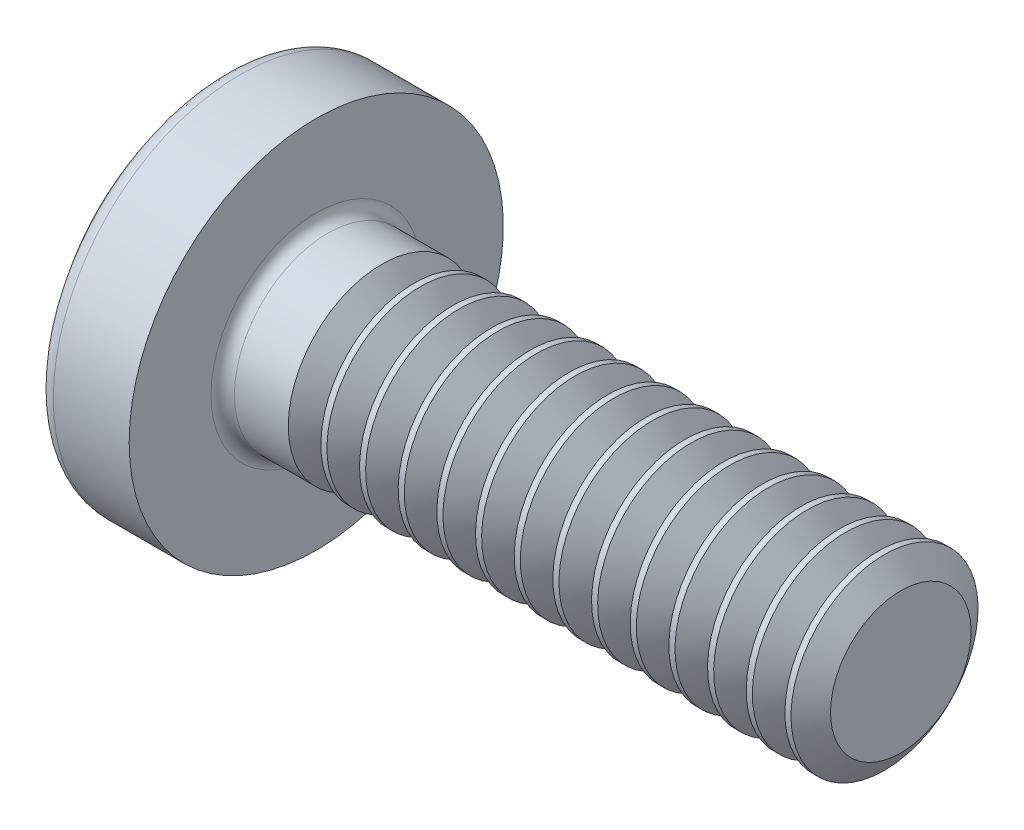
ISO-10303-21;
HEADER;
FILE_DESCRIPTION(('STEP AP214'),'2;1');
FILE_NAME('part.step','',(''),(''),'','','');
FILE_SCHEMA(('AUTOMOTIVE_DESIGN { 1 0 10303 214 1 1 1 1 }'));
ENDSEC;
DATA;
#1=APPLICATION_CONTEXT('core data for automotive mechanical design processes');
#2=APPLICATION_PROTOCOL_DEFINITION('international standard','automotive_design',2000,#1);
#3=PRODUCT_CONTEXT('',#1,'mechanical');
#4=PRODUCT('Part','Part','',(#3));
#5=PRODUCT_RELATED_PRODUCT_CATEGORY('part','',(#4));
#6=PRODUCT_DEFINITION_FORMATION('','',#4);
#7=PRODUCT_DEFINITION_CONTEXT('part definition',#1,'design');
#8=PRODUCT_DEFINITION('design','',#6,#7);
#9=PRODUCT_DEFINITION_SHAPE('','',#8);
#10=(LENGTH_UNIT() NAMED_UNIT(*) SI_UNIT(.MILLI.,.METRE.));
#11=(NAMED_UNIT(*) PLANE_ANGLE_UNIT() SI_UNIT($,.RADIAN.));
#12=(NAMED_UNIT(*) SI_UNIT($,.STERADIAN.) SOLID_ANGLE_UNIT());
#13=UNCERTAINTY_MEASURE_WITH_UNIT(LENGTH_MEASURE(1.E-05),#10,'distance_accuracy_value','');
#14=(GEOMETRIC_REPRESENTATION_CONTEXT(3) GLOBAL_UNCERTAINTY_ASSIGNED_CONTEXT((#13)) GLOBAL_UNIT_ASSIGNED_CONTEXT((#10,
#11,#12)) REPRESENTATION_CONTEXT('',''));
#15=CARTESIAN_POINT('',(0.,0.,0.));
#16=DIRECTION('',(0.,0.,1.));
#17=DIRECTION('',(1.,0.,0.));
#18=AXIS2_PLACEMENT_3D('',#15,#16,#17);
#19=CARTESIAN_POINT('',(2.5,0.,0.));
#20=DIRECTION('',(-1.,0.,0.));
#21=DIRECTION('',(0.,1.,0.));
#22=AXIS2_PLACEMENT_3D('',#19,#20,#21);
#23=SPHERICAL_SURFACE('',#22,2.5);
#24=CARTESIAN_POINT('',(0.532633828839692,0.,0.));
#25=DIRECTION('',(-1.,0.,0.));
#26=DIRECTION('',(0.,0.,1.));
#27=AXIS2_PLACEMENT_3D('',#24,#25,#26);
#28=CIRCLE('',#27,1.54255319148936);
#29=CARTESIAN_POINT('',(0.532633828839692,0.,1.54255319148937));
#30=VERTEX_POINT('',#29);
#31=EDGE_CURVE('E232',#30,#30,#28,.T.);
#32=ORIENTED_EDGE('',*,*,#31,.T.);
#33=EDGE_LOOP('',(#32));
#34=FACE_BOUND('',#33,.T.);
#35=CARTESIAN_POINT('',(0.0348536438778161,0.,0.));
#36=DIRECTION('',(1.,0.,0.));
#37=DIRECTION('',(0.,0.,-1.));
#38=AXIS2_PLACEMENT_3D('',#35,#36,#37);
#39=CIRCLE('',#38,0.415996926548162);
#40=CARTESIAN_POINT('',(0.0348536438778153,-0.239999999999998,-0.339784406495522));
#41=VERTEX_POINT('',#40);
#42=CARTESIAN_POINT('',(0.0348536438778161,-0.339784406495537,-0.239999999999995));
#43=VERTEX_POINT('',#42);
#44=EDGE_CURVE('E383',#41,#43,#39,.F.);
#45=ORIENTED_EDGE('',*,*,#44,.F.);
#46=CARTESIAN_POINT('',(2.5,-0.240000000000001,0.));
#47=DIRECTION('',(0.,1.,0.));
#48=DIRECTION('',(0.,0.,1.));
#49=AXIS2_PLACEMENT_3D('',#46,#47,#48);
#50=CIRCLE('',#49,2.48845333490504);
#51=CARTESIAN_POINT('',(0.123613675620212,-0.239999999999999,-0.738368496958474));
#52=VERTEX_POINT('',#51);
#53=EDGE_CURVE('E279',#52,#41,#50,.T.);
#54=ORIENTED_EDGE('',*,*,#53,.F.);
#55=CARTESIAN_POINT('',(2.32172300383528,0.,0.357568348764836));
#56=DIRECTION('',(0.446197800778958,0.,-0.894934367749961));
#57=DIRECTION('',(-0.89493436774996,0.,-0.446197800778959));
#58=AXIS2_PLACEMENT_3D('',#55,#56,#57);
#59=CIRCLE('',#58,2.46786591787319);
#60=CARTESIAN_POINT('',(0.123613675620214,0.240000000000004,-0.738368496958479));
#61=VERTEX_POINT('',#60);
#62=EDGE_CURVE('E251',#52,#61,#59,.T.);
#63=ORIENTED_EDGE('',*,*,#62,.T.);
#64=CARTESIAN_POINT('',(2.5,0.239999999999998,0.));
#65=DIRECTION('',(0.,-1.,0.));
#66=DIRECTION('',(0.,0.,-1.));
#67=AXIS2_PLACEMENT_3D('',#64,#65,#66);
#68=CIRCLE('',#67,2.48845333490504);
#69=CARTESIAN_POINT('',(0.0348536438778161,0.239999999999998,-0.339784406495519));
#70=VERTEX_POINT('',#69);
#71=EDGE_CURVE('E287',#70,#61,#68,.T.);
#72=ORIENTED_EDGE('',*,*,#71,.F.);
#73=CARTESIAN_POINT('',(0.0348536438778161,0.339784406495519,-0.239999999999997));
#74=VERTEX_POINT('',#73);
#75=EDGE_CURVE('E391',#74,#70,#39,.F.);
#76=ORIENTED_EDGE('',*,*,#75,.F.);
#77=CARTESIAN_POINT('',(2.5,0.,-0.239999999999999));
#78=DIRECTION('',(0.,0.,1.));
#79=DIRECTION('',(1.,0.,0.));
#80=AXIS2_PLACEMENT_3D('',#77,#78,#79);
#81=CIRCLE('',#80,2.48845333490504);
#82=CARTESIAN_POINT('',(0.123613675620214,0.73836849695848,-0.239999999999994));
#83=VERTEX_POINT('',#82);
#84=EDGE_CURVE('E245',#83,#74,#81,.T.);
#85=ORIENTED_EDGE('',*,*,#84,.F.);
#86=CARTESIAN_POINT('',(2.32172300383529,-0.357568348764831,0.));
#87=DIRECTION('',(0.446197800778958,0.894934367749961,0.));
#88=DIRECTION('',(-0.89493436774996,0.446197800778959,0.));
#89=AXIS2_PLACEMENT_3D('',#86,#87,#88);
#90=CIRCLE('',#89,2.46786591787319);
#91=CARTESIAN_POINT('',(0.123613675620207,0.738368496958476,0.240000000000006));
#92=VERTEX_POINT('',#91);
#93=EDGE_CURVE('E248',#83,#92,#90,.T.);
#94=ORIENTED_EDGE('',*,*,#93,.T.);
#95=CARTESIAN_POINT('',(2.5,0.,0.239999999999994));
#96=DIRECTION('',(0.,0.,-1.));
#97=DIRECTION('',(-1.,0.,0.));
#98=AXIS2_PLACEMENT_3D('',#95,#96,#97);
#99=CIRCLE('',#98,2.48845333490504);
#100=CARTESIAN_POINT('',(0.0348536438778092,0.339784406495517,0.240000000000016));
#101=VERTEX_POINT('',#100);
#102=EDGE_CURVE('E241',#101,#92,#99,.T.);
#103=ORIENTED_EDGE('',*,*,#102,.F.);
#104=CARTESIAN_POINT('',(0.0348536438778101,0.239999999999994,0.339784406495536));
#105=VERTEX_POINT('',#104);
#106=EDGE_CURVE('E390',#105,#101,#39,.F.);
#107=ORIENTED_EDGE('',*,*,#106,.F.);
#108=CARTESIAN_POINT('',(0.123613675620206,0.240000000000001,0.738368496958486));
#109=VERTEX_POINT('',#108);
#110=EDGE_CURVE('E261',#109,#105,#68,.T.);
#111=ORIENTED_EDGE('',*,*,#110,.F.);
#112=CARTESIAN_POINT('',(2.32172300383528,0.,-0.35756834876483));
#113=DIRECTION('',(0.446197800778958,0.,0.894934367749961));
#114=DIRECTION('',(0.89493436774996,0.,-0.446197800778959));
#115=AXIS2_PLACEMENT_3D('',#112,#113,#114);
#116=CIRCLE('',#115,2.46786591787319);
#117=CARTESIAN_POINT('',(0.123613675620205,-0.240000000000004,0.73836849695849));
#118=VERTEX_POINT('',#117);
#119=EDGE_CURVE('E37',#109,#118,#116,.T.);
#120=ORIENTED_EDGE('',*,*,#119,.T.);
#121=CARTESIAN_POINT('',(0.0348536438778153,-0.24,0.339784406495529));
#122=VERTEX_POINT('',#121);
#123=EDGE_CURVE('E258',#122,#118,#50,.T.);
#124=ORIENTED_EDGE('',*,*,#123,.F.);
#125=CARTESIAN_POINT('',(0.0348536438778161,-0.339784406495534,0.240000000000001));
#126=VERTEX_POINT('',#125);
#127=EDGE_CURVE('E425',#126,#122,#39,.F.);
#128=ORIENTED_EDGE('',*,*,#127,.F.);
#129=CARTESIAN_POINT('',(0.123613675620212,-0.738368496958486,0.240000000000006));
#130=VERTEX_POINT('',#129);
#131=EDGE_CURVE('E242',#130,#126,#99,.T.);
#132=ORIENTED_EDGE('',*,*,#131,.F.);
#133=CARTESIAN_POINT('',(2.32172300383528,0.35756834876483,0.));
#134=DIRECTION('',(0.446197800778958,-0.894934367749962,0.));
#135=DIRECTION('',(0.89493436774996,0.446197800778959,0.));
#136=AXIS2_PLACEMENT_3D('',#133,#134,#135);
#137=CIRCLE('',#136,2.46786591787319);
#138=CARTESIAN_POINT('',(0.123613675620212,-0.738368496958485,-0.239999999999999));
#139=VERTEX_POINT('',#138);
#140=EDGE_CURVE('E238',#130,#139,#137,.T.);
#141=ORIENTED_EDGE('',*,*,#140,.T.);
#142=EDGE_CURVE('E52',#43,#139,#81,.T.);
#143=ORIENTED_EDGE('',*,*,#142,.F.);
#144=EDGE_LOOP('',(#45,#54,#63,#72,#76,#85,#94,#103,#107,#111,#120,#124,#128,#132,#141,#143));
#145=FACE_BOUND('',#144,.T.);
#146=ADVANCED_FACE('F24',(#34,#145),#23,.T.);
#147=CARTESIAN_POINT('',(0.9,0.351276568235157,-0.239999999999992));
#148=DIRECTION('',(0.,0.,1.));
#149=DIRECTION('',(1.,0.,0.));
#150=AXIS2_PLACEMENT_3D('',#147,#148,#149);
#151=PLANE('',#150);
#152=ORIENTED_EDGE('',*,*,#84,.T.);
#153=CARTESIAN_POINT('',(-0.629305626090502,0.395285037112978,-0.240000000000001));
#154=CARTESIAN_POINT('',(-0.502245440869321,0.384885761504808,-0.239999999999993));
#155=CARTESIAN_POINT('',(-0.375193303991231,0.374386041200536,-0.239999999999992));
#156=CARTESIAN_POINT('',(-0.121109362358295,0.353102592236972,-0.239999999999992));
#157=CARTESIAN_POINT('',(0.00592244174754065,0.342318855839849,-0.239999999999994));
#158=CARTESIAN_POINT('',(0.259954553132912,0.320384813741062,-0.239999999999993));
#159=CARTESIAN_POINT('',(0.386954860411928,0.30923450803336,-0.239999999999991));
#160=CARTESIAN_POINT('',(0.640908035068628,0.286428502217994,-0.239999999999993));
#161=CARTESIAN_POINT('',(0.767860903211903,0.274772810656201,-0.239999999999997));
#162=CARTESIAN_POINT('',(1.02740505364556,0.250195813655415,-0.239999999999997));
#163=CARTESIAN_POINT('',(1.15999322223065,0.237241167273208,-0.239999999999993));
#164=CARTESIAN_POINT('',(1.35878055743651,0.216851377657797,-0.239999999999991));
#165=CARTESIAN_POINT('',(1.42502853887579,0.209894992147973,-0.239999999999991));
#166=CARTESIAN_POINT('',(1.55747716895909,0.19553674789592,-0.239999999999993));
#167=CARTESIAN_POINT('',(1.62367781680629,0.188134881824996,-0.239999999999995));
#168=CARTESIAN_POINT('',(1.68984631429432,0.180447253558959,-0.239999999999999));
#169=B_SPLINE_CURVE_WITH_KNOTS('',3,(#153,#154,#155,#156,#157,#158,#159,#160,#161,#162,#163,
#164,#165,#166,#167,#168),.UNSPECIFIED.,.F.,.F.,(4,2,2,2,2,2,2,4),(0.,0.382455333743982,
0.764921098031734,1.14738686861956,1.52984617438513,1.92950045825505,2.12933578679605,
2.32917440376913),.UNSPECIFIED.);
#170=CARTESIAN_POINT('',(0.9,0.262259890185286,-0.239999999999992));
#171=VERTEX_POINT('',#170);
#172=EDGE_CURVE('E410',#74,#171,#169,.T.);
#173=ORIENTED_EDGE('',*,*,#172,.T.);
#174=DIRECTION('',(0.,1.,0.));
#175=VECTOR('',#174,1.);
#176=CARTESIAN_POINT('',(0.9,-0.351276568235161,-0.239999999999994));
#177=LINE('',#176,#175);
#178=CARTESIAN_POINT('',(0.9,0.351276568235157,-0.239999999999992));
#179=VERTEX_POINT('',#178);
#180=EDGE_CURVE('E304',#171,#179,#177,.T.);
#181=ORIENTED_EDGE('',*,*,#180,.T.);
#182=DIRECTION('',(0.89493436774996,-0.446197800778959,0.));
#183=VECTOR('',#182,1.);
#184=CARTESIAN_POINT('',(0.,0.800000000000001,-0.239999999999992));
#185=LINE('',#184,#183);
#186=EDGE_CURVE('E310',#83,#179,#185,.T.);
#187=ORIENTED_EDGE('',*,*,#186,.F.);
#188=EDGE_LOOP('',(#152,#173,#181,#187));
#189=FACE_BOUND('',#188,.T.);
#190=ADVANCED_FACE('F187',(#189),#151,.T.);
#191=CARTESIAN_POINT('',(0.9,-0.351276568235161,-0.239999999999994));
#192=VERTEX_POINT('',#191);
#193=CARTESIAN_POINT('',(0.9,-0.262259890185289,-0.240000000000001));
#194=VERTEX_POINT('',#193);
#195=EDGE_CURVE('E301',#192,#194,#177,.T.);
#196=ORIENTED_EDGE('',*,*,#195,.T.);
#197=CARTESIAN_POINT('',(-0.629305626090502,-0.395285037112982,-0.23999999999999));
#198=CARTESIAN_POINT('',(-0.502245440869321,-0.384885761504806,-0.239999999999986));
#199=CARTESIAN_POINT('',(-0.375193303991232,-0.374386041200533,-0.239999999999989));
#200=CARTESIAN_POINT('',(-0.121109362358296,-0.353102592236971,-0.239999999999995));
#201=CARTESIAN_POINT('',(0.00592244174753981,-0.34231885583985,-0.24));
#202=CARTESIAN_POINT('',(0.259954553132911,-0.320384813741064,-0.239999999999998));
#203=CARTESIAN_POINT('',(0.386954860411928,-0.309234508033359,-0.239999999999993));
#204=CARTESIAN_POINT('',(0.640908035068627,-0.286428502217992,-0.239999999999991));
#205=CARTESIAN_POINT('',(0.767860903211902,-0.2747728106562,-0.239999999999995));
#206=CARTESIAN_POINT('',(1.02740505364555,-0.250195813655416,-0.239999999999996));
#207=CARTESIAN_POINT('',(1.15999322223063,-0.237241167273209,-0.239999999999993));
#208=CARTESIAN_POINT('',(1.35878055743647,-0.2168513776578,-0.239999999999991));
#209=CARTESIAN_POINT('',(1.42502853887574,-0.209894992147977,-0.239999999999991));
#210=CARTESIAN_POINT('',(1.55747716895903,-0.195536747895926,-0.239999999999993));
#211=CARTESIAN_POINT('',(1.62367781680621,-0.188134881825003,-0.239999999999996));
#212=CARTESIAN_POINT('',(1.68984631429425,-0.180447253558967,-0.240000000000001));
#213=B_SPLINE_CURVE_WITH_KNOTS('',3,(#197,#198,#199,#200,#201,#202,#203,#204,#205,#206,#207,
#208,#209,#210,#211,#212),.UNSPECIFIED.,.F.,.F.,(4,2,2,2,2,2,2,4),(0.,0.382455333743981,
0.764921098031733,1.14738686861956,1.52984617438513,1.92950045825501,2.12933578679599,
2.32917440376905),.UNSPECIFIED.);
#214=EDGE_CURVE('E389',#194,#43,#213,.F.);
#215=ORIENTED_EDGE('',*,*,#214,.T.);
#216=ORIENTED_EDGE('',*,*,#142,.T.);
#217=DIRECTION('',(0.89493436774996,0.446197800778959,0.));
#218=VECTOR('',#217,1.);
#219=CARTESIAN_POINT('',(0.,-0.800000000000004,-0.239999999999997));
#220=LINE('',#219,#218);
#221=EDGE_CURVE('E307',#139,#192,#220,.T.);
#222=ORIENTED_EDGE('',*,*,#221,.T.);
#223=EDGE_LOOP('',(#196,#215,#216,#222));
#224=FACE_BOUND('',#223,.T.);
#225=ADVANCED_FACE('F193',(#224),#151,.T.);
#226=CARTESIAN_POINT('',(0.9,-0.351276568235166,0.240000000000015));
#227=DIRECTION('',(0.,0.,-1.));
#228=DIRECTION('',(-1.,0.,0.));
#229=AXIS2_PLACEMENT_3D('',#226,#227,#228);
#230=PLANE('',#229);
#231=DIRECTION('',(0.,-1.,0.));
#232=VECTOR('',#231,1.);
#233=CARTESIAN_POINT('',(0.899999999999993,0.351276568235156,0.240000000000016));
#234=LINE('',#233,#232);
#235=CARTESIAN_POINT('',(0.899999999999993,0.351276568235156,0.240000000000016));
#236=VERTEX_POINT('',#235);
#237=CARTESIAN_POINT('',(0.899999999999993,0.262259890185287,0.240000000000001));
#238=VERTEX_POINT('',#237);
#239=EDGE_CURVE('E293',#236,#238,#234,.T.);
#240=ORIENTED_EDGE('',*,*,#239,.T.);
#241=CARTESIAN_POINT('',(-0.629305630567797,0.395285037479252,0.240000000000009));
#242=CARTESIAN_POINT('',(-0.502245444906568,0.384885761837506,0.240000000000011));
#243=CARTESIAN_POINT('',(-0.375193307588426,0.374386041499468,0.240000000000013));
#244=CARTESIAN_POINT('',(-0.121109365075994,0.353102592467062,0.240000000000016));
#245=CARTESIAN_POINT('',(0.00592243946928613,0.342318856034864,0.240000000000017));
#246=CARTESIAN_POINT('',(0.259954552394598,0.320384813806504,0.240000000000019));
#247=CARTESIAN_POINT('',(0.386954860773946,0.309234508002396,0.240000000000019));
#248=CARTESIAN_POINT('',(0.640908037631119,0.286428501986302,0.24000000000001));
#249=CARTESIAN_POINT('',(0.767860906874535,0.274772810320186,0.240000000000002));
#250=CARTESIAN_POINT('',(1.02740503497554,0.250195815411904,0.240000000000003));
#251=CARTESIAN_POINT('',(1.15999318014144,0.237241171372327,0.240000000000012));
#252=CARTESIAN_POINT('',(1.3587804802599,0.216851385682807,0.240000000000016));
#253=CARTESIAN_POINT('',(1.42502845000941,0.209895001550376,0.240000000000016));
#254=CARTESIAN_POINT('',(1.55747705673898,0.195536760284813,0.240000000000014));
#255=CARTESIAN_POINT('',(1.62367769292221,0.188134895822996,0.240000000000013));
#256=CARTESIAN_POINT('',(1.68984617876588,0.180447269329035,0.240000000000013));
#257=B_SPLINE_CURVE_WITH_KNOTS('',3,(#241,#242,#243,#244,#245,#246,#247,#248,#249,#250,#251,
#252,#253,#254,#255,#256),.UNSPECIFIED.,.F.,.F.,(4,2,2,2,2,2,2,4),(0.,0.382455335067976,
0.764921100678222,1.14738687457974,1.52984618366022,1.92950039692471,2.12933569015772,
2.32917427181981),.UNSPECIFIED.);
#258=EDGE_CURVE('E339',#238,#101,#257,.F.);
#259=ORIENTED_EDGE('',*,*,#258,.T.);
#260=ORIENTED_EDGE('',*,*,#102,.T.);
#261=DIRECTION('',(0.89493436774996,-0.446197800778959,0.));
#262=VECTOR('',#261,1.);
#263=CARTESIAN_POINT('',(0.,0.799999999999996,0.240000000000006));
#264=LINE('',#263,#262);
#265=EDGE_CURVE('E309',#92,#236,#264,.T.);
#266=ORIENTED_EDGE('',*,*,#265,.T.);
#267=EDGE_LOOP('',(#240,#259,#260,#266));
#268=FACE_BOUND('',#267,.T.);
#269=ADVANCED_FACE('F318',(#268),#230,.T.);
#270=ORIENTED_EDGE('',*,*,#131,.T.);
#271=CARTESIAN_POINT('',(-0.629305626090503,-0.395285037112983,0.240000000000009));
#272=CARTESIAN_POINT('',(-0.502245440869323,-0.384885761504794,0.240000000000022));
#273=CARTESIAN_POINT('',(-0.375193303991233,-0.374386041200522,0.24000000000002));
#274=CARTESIAN_POINT('',(-0.121109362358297,-0.353102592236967,0.240000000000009));
#275=CARTESIAN_POINT('',(0.00592244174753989,-0.342318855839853,0.240000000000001));
#276=CARTESIAN_POINT('',(0.259954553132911,-0.320384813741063,0.240000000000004));
#277=CARTESIAN_POINT('',(0.386954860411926,-0.309234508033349,0.240000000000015));
#278=CARTESIAN_POINT('',(0.640908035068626,-0.286428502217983,0.240000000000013));
#279=CARTESIAN_POINT('',(0.767860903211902,-0.274772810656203,0.24));
#280=CARTESIAN_POINT('',(1.02740505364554,-0.25019581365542,0.239999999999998));
#281=CARTESIAN_POINT('',(1.15999322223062,-0.237241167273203,0.240000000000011));
#282=CARTESIAN_POINT('',(1.35878055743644,-0.216851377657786,0.240000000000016));
#283=CARTESIAN_POINT('',(1.42502853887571,-0.209894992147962,0.240000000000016));
#284=CARTESIAN_POINT('',(1.557477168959,-0.195536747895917,0.240000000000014));
#285=CARTESIAN_POINT('',(1.62367781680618,-0.188134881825,0.240000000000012));
#286=CARTESIAN_POINT('',(1.68984631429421,-0.180447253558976,0.240000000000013));
#287=B_SPLINE_CURVE_WITH_KNOTS('',3,(#271,#272,#273,#274,#275,#276,#277,#278,#279,#280,#281,
#282,#283,#284,#285,#286),.UNSPECIFIED.,.F.,.F.,(4,2,2,2,2,2,2,4),(0.,0.382455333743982,
0.764921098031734,1.14738686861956,1.52984617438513,1.92950045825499,2.12933578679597,
2.32917440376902),.UNSPECIFIED.);
#288=CARTESIAN_POINT('',(0.9,-0.262259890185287,0.240000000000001));
#289=VERTEX_POINT('',#288);
#290=EDGE_CURVE('E426',#126,#289,#287,.T.);
#291=ORIENTED_EDGE('',*,*,#290,.T.);
#292=CARTESIAN_POINT('',(0.9,-0.351276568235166,0.240000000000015));
#293=VERTEX_POINT('',#292);
#294=EDGE_CURVE('E296',#289,#293,#234,.T.);
#295=ORIENTED_EDGE('',*,*,#294,.T.);
#296=DIRECTION('',(0.89493436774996,0.446197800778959,0.));
#297=VECTOR('',#296,1.);
#298=CARTESIAN_POINT('',(0.,-0.800000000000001,0.240000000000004));
#299=LINE('',#298,#297);
#300=EDGE_CURVE('E291',#130,#293,#299,.T.);
#301=ORIENTED_EDGE('',*,*,#300,.F.);
#302=EDGE_LOOP('',(#270,#291,#295,#301));
#303=FACE_BOUND('',#302,.T.);
#304=ADVANCED_FACE('F998',(#303),#230,.T.);
#305=CARTESIAN_POINT('',(0.899999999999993,0.351276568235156,0.240000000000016));
#306=DIRECTION('',(0.446197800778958,0.894934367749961,0.));
#307=DIRECTION('',(-0.89493436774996,0.446197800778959,0.));
#308=AXIS2_PLACEMENT_3D('',#305,#306,#307);
#309=PLANE('',#308);
#310=CARTESIAN_POINT('',(1.51667970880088,0.0438114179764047,0.));
#311=DIRECTION('',(0.446197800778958,0.894934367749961,0.));
#312=DIRECTION('',(-0.89493436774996,0.446197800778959,0.));
#313=AXIS2_PLACEMENT_3D('',#310,#311,#312);
#314=ELLIPSE('',#313,0.700087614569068,0.309289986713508);
#315=CARTESIAN_POINT('',(0.9,0.351276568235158,0.0546353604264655));
#316=VERTEX_POINT('',#315);
#317=CARTESIAN_POINT('',(0.9,0.351276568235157,-0.0546353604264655));
#318=VERTEX_POINT('',#317);
#319=EDGE_CURVE('E331',#316,#318,#314,.F.);
#320=ORIENTED_EDGE('',*,*,#319,.F.);
#321=DIRECTION('',(0.,0.,-1.));
#322=VECTOR('',#321,1.);
#323=CARTESIAN_POINT('',(0.899999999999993,0.351276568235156,0.240000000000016));
#324=LINE('',#323,#322);
#325=EDGE_CURVE('E297',#236,#316,#324,.T.);
#326=ORIENTED_EDGE('',*,*,#325,.F.);
#327=ORIENTED_EDGE('',*,*,#265,.F.);
#328=ORIENTED_EDGE('',*,*,#93,.F.);
#329=ORIENTED_EDGE('',*,*,#186,.T.);
#330=EDGE_CURVE('E300',#318,#179,#324,.T.);
#331=ORIENTED_EDGE('',*,*,#330,.F.);
#332=EDGE_LOOP('',(#320,#326,#327,#328,#329,#331));
#333=FACE_BOUND('',#332,.T.);
#334=ADVANCED_FACE('F329',(#333),#309,.F.);
#335=CARTESIAN_POINT('',(0.,-0.800000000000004,-0.239999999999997));
#336=DIRECTION('',(0.446197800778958,-0.894934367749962,0.));
#337=DIRECTION('',(0.89493436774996,0.446197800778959,0.));
#338=AXIS2_PLACEMENT_3D('',#335,#336,#337);
#339=PLANE('',#338);
#340=CARTESIAN_POINT('',(1.51667970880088,-0.0438114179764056,0.));
#341=DIRECTION('',(0.446197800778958,-0.894934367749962,0.));
#342=DIRECTION('',(-0.89493436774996,-0.446197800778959,0.));
#343=AXIS2_PLACEMENT_3D('',#340,#341,#342);
#344=ELLIPSE('',#343,0.700087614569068,0.309289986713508);
#345=CARTESIAN_POINT('',(0.9,-0.35127656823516,-0.054635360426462));
#346=VERTEX_POINT('',#345);
#347=CARTESIAN_POINT('',(0.9,-0.351276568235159,0.054635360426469));
#348=VERTEX_POINT('',#347);
#349=EDGE_CURVE('E335',#346,#348,#344,.F.);
#350=ORIENTED_EDGE('',*,*,#349,.F.);
#351=DIRECTION('',(0.,0.,1.));
#352=VECTOR('',#351,1.);
#353=CARTESIAN_POINT('',(0.9,-0.351276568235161,-0.239999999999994));
#354=LINE('',#353,#352);
#355=EDGE_CURVE('E288',#192,#346,#354,.T.);
#356=ORIENTED_EDGE('',*,*,#355,.F.);
#357=ORIENTED_EDGE('',*,*,#221,.F.);
#358=ORIENTED_EDGE('',*,*,#140,.F.);
#359=ORIENTED_EDGE('',*,*,#300,.T.);
#360=EDGE_CURVE('E292',#348,#293,#354,.T.);
#361=ORIENTED_EDGE('',*,*,#360,.F.);
#362=EDGE_LOOP('',(#350,#356,#357,#358,#359,#361));
#363=FACE_BOUND('',#362,.T.);
#364=ADVANCED_FACE('F1010',(#363),#339,.F.);
#365=CARTESIAN_POINT('',(0.9,0.351276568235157,-0.239999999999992));
#366=DIRECTION('',(-1.,0.,0.));
#367=DIRECTION('',(0.,0.,1.));
#368=AXIS2_PLACEMENT_3D('',#365,#366,#367);
#369=PLANE('',#368);
#370=DIRECTION('',(0.,1.,0.));
#371=VECTOR('',#370,1.);
#372=CARTESIAN_POINT('',(0.9,-0.24,0.351276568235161));
#373=LINE('',#372,#371);
#374=CARTESIAN_POINT('',(0.9,-0.24,0.351276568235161));
#375=VERTEX_POINT('',#374);
#376=CARTESIAN_POINT('',(0.9,-0.054635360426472,0.351276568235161));
#377=VERTEX_POINT('',#376);
#378=EDGE_CURVE('E352',#375,#377,#373,.T.);
#379=ORIENTED_EDGE('',*,*,#378,.T.);
#380=CARTESIAN_POINT('',(0.9,0.,0.));
#381=DIRECTION('',(-1.,0.,0.));
#382=DIRECTION('',(0.,0.,1.));
#383=AXIS2_PLACEMENT_3D('',#380,#381,#382);
#384=CIRCLE('',#383,0.355499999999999);
#385=CARTESIAN_POINT('',(0.9,-0.240000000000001,0.262259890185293));
#386=VERTEX_POINT('',#385);
#387=EDGE_CURVE('E474',#386,#377,#384,.T.);
#388=ORIENTED_EDGE('',*,*,#387,.F.);
#389=DIRECTION('',(0.,0.,-1.));
#390=VECTOR('',#389,1.);
#391=CARTESIAN_POINT('',(0.9,-0.24,0.351276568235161));
#392=LINE('',#391,#390);
#393=EDGE_CURVE('E348',#375,#386,#392,.T.);
#394=ORIENTED_EDGE('',*,*,#393,.F.);
#395=EDGE_LOOP('',(#379,#388,#394));
#396=FACE_BOUND('',#395,.T.);
#397=ADVANCED_FACE('F472',(#396),#369,.T.);
#398=ORIENTED_EDGE('',*,*,#294,.F.);
#399=EDGE_CURVE('E481',#348,#289,#384,.T.);
#400=ORIENTED_EDGE('',*,*,#399,.F.);
#401=ORIENTED_EDGE('',*,*,#360,.T.);
#402=EDGE_LOOP('',(#398,#400,#401));
#403=FACE_BOUND('',#402,.T.);
#404=ADVANCED_FACE('F1022',(#403),#369,.T.);
#405=ORIENTED_EDGE('',*,*,#355,.T.);
#406=EDGE_CURVE('E1133',#194,#346,#384,.T.);
#407=ORIENTED_EDGE('',*,*,#406,.F.);
#408=ORIENTED_EDGE('',*,*,#195,.F.);
#409=EDGE_LOOP('',(#405,#407,#408));
#410=FACE_BOUND('',#409,.T.);
#411=ADVANCED_FACE('F1030',(#410),#369,.T.);
#412=CARTESIAN_POINT('',(0.9,-0.24,-0.262259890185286));
#413=VERTEX_POINT('',#412);
#414=CARTESIAN_POINT('',(0.9,-0.240000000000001,-0.351276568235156));
#415=VERTEX_POINT('',#414);
#416=EDGE_CURVE('E351',#413,#415,#392,.T.);
#417=ORIENTED_EDGE('',*,*,#416,.F.);
#418=CARTESIAN_POINT('',(0.9,-0.0546353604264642,-0.351276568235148));
#419=VERTEX_POINT('',#418);
#420=EDGE_CURVE('E44',#419,#413,#384,.T.);
#421=ORIENTED_EDGE('',*,*,#420,.F.);
#422=DIRECTION('',(0.,-1.,0.));
#423=VECTOR('',#422,1.);
#424=CARTESIAN_POINT('',(0.9,0.240000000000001,-0.351276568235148));
#425=LINE('',#424,#423);
#426=EDGE_CURVE('E347',#419,#415,#425,.T.);
#427=ORIENTED_EDGE('',*,*,#426,.T.);
#428=EDGE_LOOP('',(#417,#421,#427));
#429=FACE_BOUND('',#428,.T.);
#430=ADVANCED_FACE('F1038',(#429),#369,.T.);
#431=CARTESIAN_POINT('',(0.9,0.240000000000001,-0.351276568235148));
#432=VERTEX_POINT('',#431);
#433=CARTESIAN_POINT('',(0.9,0.0546353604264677,-0.351276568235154));
#434=VERTEX_POINT('',#433);
#435=EDGE_CURVE('E343',#432,#434,#425,.T.);
#436=ORIENTED_EDGE('',*,*,#435,.T.);
#437=CARTESIAN_POINT('',(0.9,0.240000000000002,-0.262259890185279));
#438=VERTEX_POINT('',#437);
#439=EDGE_CURVE('E374',#438,#434,#384,.T.);
#440=ORIENTED_EDGE('',*,*,#439,.F.);
#441=DIRECTION('',(0.,0.,1.));
#442=VECTOR('',#441,1.);
#443=CARTESIAN_POINT('',(0.9,0.240000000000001,-0.351276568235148));
#444=LINE('',#443,#442);
#445=EDGE_CURVE('E337',#432,#438,#444,.T.);
#446=ORIENTED_EDGE('',*,*,#445,.F.);
#447=EDGE_LOOP('',(#436,#440,#446));
#448=FACE_BOUND('',#447,.T.);
#449=ADVANCED_FACE('F372',(#448),#369,.T.);
#450=ORIENTED_EDGE('',*,*,#180,.F.);
#451=EDGE_CURVE('E379',#318,#171,#384,.T.);
#452=ORIENTED_EDGE('',*,*,#451,.F.);
#453=ORIENTED_EDGE('',*,*,#330,.T.);
#454=EDGE_LOOP('',(#450,#452,#453));
#455=FACE_BOUND('',#454,.T.);
#456=ADVANCED_FACE('F460',(#455),#369,.T.);
#457=ORIENTED_EDGE('',*,*,#325,.T.);
#458=EDGE_CURVE('E327',#238,#316,#384,.T.);
#459=ORIENTED_EDGE('',*,*,#458,.F.);
#460=ORIENTED_EDGE('',*,*,#239,.F.);
#461=EDGE_LOOP('',(#457,#459,#460));
#462=FACE_BOUND('',#461,.T.);
#463=ADVANCED_FACE('F325',(#462),#369,.T.);
#464=CARTESIAN_POINT('',(0.899999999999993,0.239999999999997,0.262259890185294));
#465=VERTEX_POINT('',#464);
#466=CARTESIAN_POINT('',(0.899999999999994,0.239999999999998,0.35127656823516));
#467=VERTEX_POINT('',#466);
#468=EDGE_CURVE('E276',#465,#467,#444,.T.);
#469=ORIENTED_EDGE('',*,*,#468,.F.);
#470=CARTESIAN_POINT('',(0.9,0.0546353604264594,0.351276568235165));
#471=VERTEX_POINT('',#470);
#472=EDGE_CURVE('E380',#471,#465,#384,.T.);
#473=ORIENTED_EDGE('',*,*,#472,.F.);
#474=EDGE_CURVE('E354',#471,#467,#373,.T.);
#475=ORIENTED_EDGE('',*,*,#474,.T.);
#476=EDGE_LOOP('',(#469,#473,#475));
#477=FACE_BOUND('',#476,.T.);
#478=ADVANCED_FACE('F439',(#477),#369,.T.);
#479=CARTESIAN_POINT('',(0.899999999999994,0.239999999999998,0.35127656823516));
#480=DIRECTION('',(0.,-1.,0.));
#481=DIRECTION('',(1.,0.,0.));
#482=AXIS2_PLACEMENT_3D('',#479,#480,#481);
#483=PLANE('',#482);
#484=ORIENTED_EDGE('',*,*,#110,.T.);
#485=CARTESIAN_POINT('',(-0.629305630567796,0.239999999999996,0.39528503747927));
#486=CARTESIAN_POINT('',(-0.502245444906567,0.240000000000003,0.384885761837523));
#487=CARTESIAN_POINT('',(-0.375193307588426,0.240000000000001,0.374386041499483));
#488=CARTESIAN_POINT('',(-0.121109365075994,0.239999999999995,0.353102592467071));
#489=CARTESIAN_POINT('',(0.005922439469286,0.239999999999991,0.342318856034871));
#490=CARTESIAN_POINT('',(0.259954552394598,0.239999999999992,0.320384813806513));
#491=CARTESIAN_POINT('',(0.386954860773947,0.239999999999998,0.309234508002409));
#492=CARTESIAN_POINT('',(0.640908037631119,0.239999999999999,0.286428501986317));
#493=CARTESIAN_POINT('',(0.767860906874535,0.239999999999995,0.274772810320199));
#494=CARTESIAN_POINT('',(1.02740503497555,0.239999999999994,0.250195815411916));
#495=CARTESIAN_POINT('',(1.15999318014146,0.239999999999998,0.237241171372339));
#496=CARTESIAN_POINT('',(1.35878048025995,0.24,0.216851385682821));
#497=CARTESIAN_POINT('',(1.42502845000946,0.239999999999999,0.209895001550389));
#498=CARTESIAN_POINT('',(1.55747705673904,0.239999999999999,0.195536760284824));
#499=CARTESIAN_POINT('',(1.62367769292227,0.239999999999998,0.188134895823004));
#500=CARTESIAN_POINT('',(1.68984617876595,0.239999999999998,0.180447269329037));
#501=B_SPLINE_CURVE_WITH_KNOTS('',3,(#485,#486,#487,#488,#489,#490,#491,#492,#493,#494,#495,
#496,#497,#498,#499,#500),.UNSPECIFIED.,.F.,.F.,(4,2,2,2,2,2,2,4),(0.,0.382455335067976,
0.764921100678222,1.14738687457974,1.52984618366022,1.92950039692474,2.12933569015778,
2.32917427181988),.UNSPECIFIED.);
#502=EDGE_CURVE('E442',#105,#465,#501,.T.);
#503=ORIENTED_EDGE('',*,*,#502,.T.);
#504=ORIENTED_EDGE('',*,*,#468,.T.);
#505=DIRECTION('',(0.89493436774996,0.,-0.446197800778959));
#506=VECTOR('',#505,1.);
#507=CARTESIAN_POINT('',(0.,0.239999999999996,0.800000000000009));
#508=LINE('',#507,#506);
#509=EDGE_CURVE('E269',#109,#467,#508,.T.);
#510=ORIENTED_EDGE('',*,*,#509,.F.);
#511=EDGE_LOOP('',(#484,#503,#504,#510));
#512=FACE_BOUND('',#511,.T.);
#513=ADVANCED_FACE('F273',(#512),#483,.T.);
#514=CARTESIAN_POINT('',(0.9,-0.240000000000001,-0.351276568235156));
#515=DIRECTION('',(0.,1.,0.));
#516=DIRECTION('',(-1.,0.,0.));
#517=AXIS2_PLACEMENT_3D('',#514,#515,#516);
#518=PLANE('',#517);
#519=ORIENTED_EDGE('',*,*,#393,.T.);
#520=CARTESIAN_POINT('',(-0.62930563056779,-0.240000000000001,0.395285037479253));
#521=CARTESIAN_POINT('',(-0.50224544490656,-0.240000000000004,0.384885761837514));
#522=CARTESIAN_POINT('',(-0.375193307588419,-0.240000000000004,0.374386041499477));
#523=CARTESIAN_POINT('',(-0.121109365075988,-0.240000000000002,0.353102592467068));
#524=CARTESIAN_POINT('',(0.00592243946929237,-0.24,0.342318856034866));
#525=CARTESIAN_POINT('',(0.259954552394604,-0.240000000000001,0.320384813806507));
#526=CARTESIAN_POINT('',(0.386954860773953,-0.240000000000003,0.309234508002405));
#527=CARTESIAN_POINT('',(0.640908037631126,-0.240000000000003,0.28642850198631));
#528=CARTESIAN_POINT('',(0.767860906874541,-0.24,0.274772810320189));
#529=CARTESIAN_POINT('',(1.02740503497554,-0.24,0.250195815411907));
#530=CARTESIAN_POINT('',(1.15999318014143,-0.240000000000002,0.237241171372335));
#531=CARTESIAN_POINT('',(1.35878048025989,-0.240000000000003,0.21685138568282));
#532=CARTESIAN_POINT('',(1.4250284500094,-0.240000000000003,0.20989500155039));
#533=CARTESIAN_POINT('',(1.55747705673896,-0.240000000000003,0.195536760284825));
#534=CARTESIAN_POINT('',(1.62367769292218,-0.240000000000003,0.188134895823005));
#535=CARTESIAN_POINT('',(1.68984617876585,-0.240000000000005,0.180447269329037));
#536=B_SPLINE_CURVE_WITH_KNOTS('',3,(#520,#521,#522,#523,#524,#525,#526,#527,#528,#529,#530,
#531,#532,#533,#534,#535),.UNSPECIFIED.,.F.,.F.,(4,2,2,2,2,2,2,4),(0.,0.382455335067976,
0.764921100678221,1.14738687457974,1.52984618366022,1.92950039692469,2.1293356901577,
2.32917427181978),.UNSPECIFIED.);
#537=EDGE_CURVE('E419',#386,#122,#536,.F.);
#538=ORIENTED_EDGE('',*,*,#537,.T.);
#539=ORIENTED_EDGE('',*,*,#123,.T.);
#540=DIRECTION('',(0.89493436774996,0.,-0.446197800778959));
#541=VECTOR('',#540,1.);
#542=CARTESIAN_POINT('',(0.,-0.240000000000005,0.800000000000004));
#543=LINE('',#542,#541);
#544=EDGE_CURVE('E271',#118,#375,#543,.T.);
#545=ORIENTED_EDGE('',*,*,#544,.T.);
#546=EDGE_LOOP('',(#519,#538,#539,#545));
#547=FACE_BOUND('',#546,.T.);
#548=ADVANCED_FACE('F431',(#547),#518,.T.);
#549=CARTESIAN_POINT('',(0.9,-0.24,0.351276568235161));
#550=DIRECTION('',(0.446197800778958,0.,0.894934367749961));
#551=DIRECTION('',(-0.89493436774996,0.,0.446197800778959));
#552=AXIS2_PLACEMENT_3D('',#549,#550,#551);
#553=PLANE('',#552);
#554=CARTESIAN_POINT('',(1.51667970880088,0.,0.0438114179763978));
#555=DIRECTION('',(0.446197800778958,0.,0.894934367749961));
#556=DIRECTION('',(-0.89493436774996,0.,0.446197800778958));
#557=AXIS2_PLACEMENT_3D('',#554,#555,#556);
#558=ELLIPSE('',#557,0.700087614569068,0.309289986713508);
#559=EDGE_CURVE('E417',#377,#471,#558,.F.);
#560=ORIENTED_EDGE('',*,*,#559,.F.);
#561=ORIENTED_EDGE('',*,*,#378,.F.);
#562=ORIENTED_EDGE('',*,*,#544,.F.);
#563=ORIENTED_EDGE('',*,*,#119,.F.);
#564=ORIENTED_EDGE('',*,*,#509,.T.);
#565=ORIENTED_EDGE('',*,*,#474,.F.);
#566=EDGE_LOOP('',(#560,#561,#562,#563,#564,#565));
#567=FACE_BOUND('',#566,.T.);
#568=ADVANCED_FACE('F267',(#567),#553,.F.);
#569=CARTESIAN_POINT('',(0.,0.240000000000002,-0.799999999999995));
#570=DIRECTION('',(0.446197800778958,0.,-0.894934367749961));
#571=DIRECTION('',(0.89493436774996,0.,0.446197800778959));
#572=AXIS2_PLACEMENT_3D('',#569,#570,#571);
#573=PLANE('',#572);
#574=CARTESIAN_POINT('',(1.51667970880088,0.,-0.0438114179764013));
#575=DIRECTION('',(0.446197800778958,0.,-0.894934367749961));
#576=DIRECTION('',(-0.89493436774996,0.,-0.446197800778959));
#577=AXIS2_PLACEMENT_3D('',#574,#575,#576);
#578=ELLIPSE('',#577,0.700087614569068,0.309289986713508);
#579=EDGE_CURVE('E369',#434,#419,#578,.F.);
#580=ORIENTED_EDGE('',*,*,#579,.F.);
#581=ORIENTED_EDGE('',*,*,#435,.F.);
#582=DIRECTION('',(0.89493436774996,0.,0.446197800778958));
#583=VECTOR('',#582,1.);
#584=CARTESIAN_POINT('',(0.,0.240000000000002,-0.799999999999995));
#585=LINE('',#584,#583);
#586=EDGE_CURVE('E281',#61,#432,#585,.T.);
#587=ORIENTED_EDGE('',*,*,#586,.F.);
#588=ORIENTED_EDGE('',*,*,#62,.F.);
#589=DIRECTION('',(0.89493436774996,0.,0.446197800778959));
#590=VECTOR('',#589,1.);
#591=CARTESIAN_POINT('',(0.,-0.239999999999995,-0.800000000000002));
#592=LINE('',#591,#590);
#593=EDGE_CURVE('E346',#52,#415,#592,.T.);
#594=ORIENTED_EDGE('',*,*,#593,.T.);
#595=ORIENTED_EDGE('',*,*,#426,.F.);
#596=EDGE_LOOP('',(#580,#581,#587,#588,#594,#595));
#597=FACE_BOUND('',#596,.T.);
#598=ADVANCED_FACE('F368',(#597),#573,.F.);
#599=ORIENTED_EDGE('',*,*,#445,.T.);
#600=CARTESIAN_POINT('',(-0.62930563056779,0.240000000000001,-0.395285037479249));
#601=CARTESIAN_POINT('',(-0.502245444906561,0.240000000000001,-0.384885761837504));
#602=CARTESIAN_POINT('',(-0.375193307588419,0.240000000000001,-0.374386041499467));
#603=CARTESIAN_POINT('',(-0.121109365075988,0.240000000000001,-0.353102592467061));
#604=CARTESIAN_POINT('',(0.00592243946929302,0.240000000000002,-0.342318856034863));
#605=CARTESIAN_POINT('',(0.259954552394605,0.240000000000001,-0.320384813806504));
#606=CARTESIAN_POINT('',(0.386954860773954,0.240000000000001,-0.309234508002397));
#607=CARTESIAN_POINT('',(0.640908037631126,0.240000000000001,-0.286428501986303));
#608=CARTESIAN_POINT('',(0.767860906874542,0.240000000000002,-0.274772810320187));
#609=CARTESIAN_POINT('',(1.02740503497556,0.240000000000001,-0.250195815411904));
#610=CARTESIAN_POINT('',(1.15999318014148,0.240000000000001,-0.237241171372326));
#611=CARTESIAN_POINT('',(1.35878048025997,0.240000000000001,-0.216851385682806));
#612=CARTESIAN_POINT('',(1.42502845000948,0.240000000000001,-0.209895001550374));
#613=CARTESIAN_POINT('',(1.55747705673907,0.24,-0.195536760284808));
#614=CARTESIAN_POINT('',(1.6236776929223,0.24,-0.188134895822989));
#615=CARTESIAN_POINT('',(1.68984617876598,0.239999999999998,-0.180447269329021));
#616=B_SPLINE_CURVE_WITH_KNOTS('',3,(#600,#601,#602,#603,#604,#605,#606,#607,#608,#609,#610,
#611,#612,#613,#614,#615),.UNSPECIFIED.,.F.,.F.,(4,2,2,2,2,2,2,4),(0.,0.382455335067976,
0.764921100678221,1.14738687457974,1.52984618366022,1.92950039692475,2.12933569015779,
2.32917427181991),.UNSPECIFIED.);
#617=EDGE_CURVE('E396',#438,#70,#616,.F.);
#618=ORIENTED_EDGE('',*,*,#617,.T.);
#619=ORIENTED_EDGE('',*,*,#71,.T.);
#620=ORIENTED_EDGE('',*,*,#586,.T.);
#621=EDGE_LOOP('',(#599,#618,#619,#620));
#622=FACE_BOUND('',#621,.T.);
#623=ADVANCED_FACE('F363',(#622),#483,.T.);
#624=ORIENTED_EDGE('',*,*,#53,.T.);
#625=CARTESIAN_POINT('',(-0.629305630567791,-0.240000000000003,-0.395285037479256));
#626=CARTESIAN_POINT('',(-0.502245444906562,-0.239999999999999,-0.384885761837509));
#627=CARTESIAN_POINT('',(-0.37519330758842,-0.239999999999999,-0.374386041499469));
#628=CARTESIAN_POINT('',(-0.121109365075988,-0.240000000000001,-0.353102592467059));
#629=CARTESIAN_POINT('',(0.00592243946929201,-0.240000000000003,-0.342318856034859));
#630=CARTESIAN_POINT('',(0.259954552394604,-0.240000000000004,-0.3203848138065));
#631=CARTESIAN_POINT('',(0.386954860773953,-0.240000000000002,-0.309234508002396));
#632=CARTESIAN_POINT('',(0.640908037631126,-0.239999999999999,-0.286428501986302));
#633=CARTESIAN_POINT('',(0.767860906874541,-0.239999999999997,-0.274772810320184));
#634=CARTESIAN_POINT('',(1.02740503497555,-0.239999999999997,-0.250195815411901));
#635=CARTESIAN_POINT('',(1.15999318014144,-0.24,-0.237241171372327));
#636=CARTESIAN_POINT('',(1.3587804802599,-0.240000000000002,-0.21685138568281));
#637=CARTESIAN_POINT('',(1.42502845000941,-0.240000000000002,-0.20989500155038));
#638=CARTESIAN_POINT('',(1.55747705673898,-0.240000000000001,-0.195536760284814));
#639=CARTESIAN_POINT('',(1.6236776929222,-0.240000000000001,-0.188134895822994));
#640=CARTESIAN_POINT('',(1.68984617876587,-0.240000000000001,-0.180447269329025));
#641=B_SPLINE_CURVE_WITH_KNOTS('',3,(#625,#626,#627,#628,#629,#630,#631,#632,#633,#634,#635,
#636,#637,#638,#639,#640),.UNSPECIFIED.,.F.,.F.,(4,2,2,2,2,2,2,4),(0.,0.382455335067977,
0.764921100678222,1.14738687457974,1.52984618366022,1.9295003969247,2.12933569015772,
2.3291742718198),.UNSPECIFIED.);
#642=EDGE_CURVE('E11',#41,#413,#641,.T.);
#643=ORIENTED_EDGE('',*,*,#642,.T.);
#644=ORIENTED_EDGE('',*,*,#416,.T.);
#645=ORIENTED_EDGE('',*,*,#593,.F.);
#646=EDGE_LOOP('',(#624,#643,#644,#645));
#647=FACE_BOUND('',#646,.T.);
#648=ADVANCED_FACE('F216',(#647),#518,.T.);
#649=CARTESIAN_POINT('',(-25.4,0.,0.));
#650=DIRECTION('',(-1.,0.,0.));
#651=DIRECTION('',(0.,0.,1.));
#652=AXIS2_PLACEMENT_3D('',#649,#650,#651);
#653=CYLINDRICAL_SURFACE('',#652,0.8);
#654=CARTESIAN_POINT('',(1.86065869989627,0.,0.));
#655=DIRECTION('',(-1.,0.,0.));
#656=DIRECTION('',(0.,-1.,0.));
#657=AXIS2_PLACEMENT_3D('',#654,#655,#656);
#658=CIRCLE('',#657,0.800000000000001);
#659=CARTESIAN_POINT('',(1.86065869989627,-0.800000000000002,0.));
#660=VERTEX_POINT('',#659);
#661=EDGE_CURVE('E484',#660,#660,#658,.T.);
#662=ORIENTED_EDGE('',*,*,#661,.T.);
#663=EDGE_LOOP('',(#662));
#664=FACE_BOUND('',#663,.T.);
#665=CARTESIAN_POINT('',(1.4,0.,0.));
#666=DIRECTION('',(-1.,0.,0.));
#667=DIRECTION('',(0.,0.,1.));
#668=AXIS2_PLACEMENT_3D('',#665,#666,#667);
#669=CIRCLE('',#668,0.8);
#670=CARTESIAN_POINT('',(1.4,0.,0.800000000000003));
#671=VERTEX_POINT('',#670);
#672=EDGE_CURVE('E229',#671,#671,#669,.F.);
#673=ORIENTED_EDGE('',*,*,#672,.T.);
#674=EDGE_LOOP('',(#673));
#675=FACE_BOUND('',#674,.T.);
#676=ADVANCED_FACE('F26',(#664,#675),#653,.T.);
#677=CARTESIAN_POINT('',(1.3,0.800000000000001,0.));
#678=DIRECTION('',(-1.,0.,0.));
#679=DIRECTION('',(0.,0.,1.));
#680=AXIS2_PLACEMENT_3D('',#677,#678,#679);
#681=PLANE('',#680);
#682=CARTESIAN_POINT('',(1.3,0.,0.));
#683=DIRECTION('',(-1.,0.,0.));
#684=DIRECTION('',(0.,0.,1.));
#685=AXIS2_PLACEMENT_3D('',#682,#683,#684);
#686=CIRCLE('',#685,0.9);
#687=CARTESIAN_POINT('',(1.3,0.,0.900000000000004));
#688=VERTEX_POINT('',#687);
#689=EDGE_CURVE('E223',#688,#688,#686,.T.);
#690=ORIENTED_EDGE('',*,*,#689,.T.);
#691=EDGE_LOOP('',(#690));
#692=FACE_BOUND('',#691,.T.);
#693=CARTESIAN_POINT('',(1.3,0.,0.));
#694=DIRECTION('',(-1.,0.,0.));
#695=DIRECTION('',(0.,0.,1.));
#696=AXIS2_PLACEMENT_3D('',#693,#694,#695);
#697=CIRCLE('',#696,1.6);
#698=CARTESIAN_POINT('',(1.3,0.,1.60000000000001));
#699=VERTEX_POINT('',#698);
#700=EDGE_CURVE('E226',#699,#699,#697,.T.);
#701=ORIENTED_EDGE('',*,*,#700,.F.);
#702=EDGE_LOOP('',(#701));
#703=FACE_BOUND('',#702,.T.);
#704=ADVANCED_FACE('F209',(#692,#703),#681,.F.);
#705=CARTESIAN_POINT('',(-25.4,0.,0.));
#706=DIRECTION('',(-1.,0.,0.));
#707=DIRECTION('',(0.,0.,1.));
#708=AXIS2_PLACEMENT_3D('',#705,#706,#707);
#709=CYLINDRICAL_SURFACE('',#708,1.6);
#710=ORIENTED_EDGE('',*,*,#700,.T.);
#711=EDGE_LOOP('',(#710));
#712=FACE_BOUND('',#711,.T.);
#713=CARTESIAN_POINT('',(0.65067579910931,0.,0.));
#714=DIRECTION('',(-1.,0.,0.));
#715=DIRECTION('',(0.,0.,1.));
#716=AXIS2_PLACEMENT_3D('',#713,#714,#715);
#717=CIRCLE('',#716,1.6);
#718=CARTESIAN_POINT('',(0.65067579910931,0.,1.60000000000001));
#719=VERTEX_POINT('',#718);
#720=EDGE_CURVE('E227',#719,#719,#717,.T.);
#721=ORIENTED_EDGE('',*,*,#720,.F.);
#722=EDGE_LOOP('',(#721));
#723=FACE_BOUND('',#722,.T.);
#724=ADVANCED_FACE('F206',(#712,#723),#709,.T.);
#725=CARTESIAN_POINT('',(0.65067579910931,0.,0.));
#726=DIRECTION('',(-1.,0.,0.));
#727=DIRECTION('',(0.,0.,1.));
#728=AXIS2_PLACEMENT_3D('',#725,#726,#727);
#729=TOROIDAL_SURFACE('',#728,1.45,0.15);
#730=ORIENTED_EDGE('',*,*,#720,.T.);
#731=EDGE_LOOP('',(#730));
#732=FACE_BOUND('',#731,.T.);
#733=ORIENTED_EDGE('',*,*,#31,.F.);
#734=EDGE_LOOP('',(#733));
#735=FACE_BOUND('',#734,.T.);
#736=ADVANCED_FACE('F202',(#732,#735),#729,.T.);
#737=CARTESIAN_POINT('',(1.4,0.,0.));
#738=DIRECTION('',(-1.,0.,0.));
#739=DIRECTION('',(0.,0.,1.));
#740=AXIS2_PLACEMENT_3D('',#737,#738,#739);
#741=TOROIDAL_SURFACE('',#740,0.9,0.1);
#742=ORIENTED_EDGE('',*,*,#672,.F.);
#743=EDGE_LOOP('',(#742));
#744=FACE_BOUND('',#743,.T.);
#745=ORIENTED_EDGE('',*,*,#689,.F.);
#746=EDGE_LOOP('',(#745));
#747=FACE_BOUND('',#746,.T.);
#748=ADVANCED_FACE('F205',(#744,#747),#741,.F.);
#749=CARTESIAN_POINT('',(0.9,0.,0.));
#750=DIRECTION('',(-1.,0.,0.));
#751=DIRECTION('',(0.,0.,1.));
#752=AXIS2_PLACEMENT_3D('',#749,#750,#751);
#753=CONICAL_SURFACE('',#752,0.355499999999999,0.0698131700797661);
#754=ORIENTED_EDGE('',*,*,#319,.T.);
#755=EDGE_CURVE('E462',#316,#318,#384,.T.);
#756=ORIENTED_EDGE('',*,*,#755,.F.);
#757=EDGE_LOOP('',(#754,#756));
#758=FACE_BOUND('',#757,.T.);
#759=ADVANCED_FACE('F184',(#758),#753,.F.);
#760=ORIENTED_EDGE('',*,*,#349,.T.);
#761=EDGE_CURVE('E482',#346,#348,#384,.T.);
#762=ORIENTED_EDGE('',*,*,#761,.F.);
#763=EDGE_LOOP('',(#760,#762));
#764=FACE_BOUND('',#763,.T.);
#765=ADVANCED_FACE('F969',(#764),#753,.F.);
#766=EDGE_CURVE('E384',#465,#238,#384,.T.);
#767=ORIENTED_EDGE('',*,*,#766,.F.);
#768=ORIENTED_EDGE('',*,*,#502,.F.);
#769=ORIENTED_EDGE('',*,*,#106,.T.);
#770=ORIENTED_EDGE('',*,*,#258,.F.);
#771=EDGE_LOOP('',(#767,#768,#769,#770));
#772=FACE_BOUND('',#771,.T.);
#773=ADVANCED_FACE('F466',(#772),#753,.F.);
#774=ORIENTED_EDGE('',*,*,#559,.T.);
#775=EDGE_CURVE('E385',#377,#471,#384,.T.);
#776=ORIENTED_EDGE('',*,*,#775,.F.);
#777=EDGE_LOOP('',(#774,#776));
#778=FACE_BOUND('',#777,.T.);
#779=ADVANCED_FACE('F957',(#778),#753,.F.);
#780=ORIENTED_EDGE('',*,*,#579,.T.);
#781=EDGE_CURVE('E377',#434,#419,#384,.T.);
#782=ORIENTED_EDGE('',*,*,#781,.F.);
#783=EDGE_LOOP('',(#780,#782));
#784=FACE_BOUND('',#783,.T.);
#785=ADVANCED_FACE('F951',(#784),#753,.F.);
#786=ORIENTED_EDGE('',*,*,#127,.T.);
#787=ORIENTED_EDGE('',*,*,#537,.F.);
#788=EDGE_CURVE('E477',#289,#386,#384,.T.);
#789=ORIENTED_EDGE('',*,*,#788,.F.);
#790=ORIENTED_EDGE('',*,*,#290,.F.);
#791=EDGE_LOOP('',(#786,#787,#789,#790));
#792=FACE_BOUND('',#791,.T.);
#793=ADVANCED_FACE('F476',(#792),#753,.F.);
#794=ORIENTED_EDGE('',*,*,#75,.T.);
#795=ORIENTED_EDGE('',*,*,#617,.F.);
#796=EDGE_CURVE('E376',#171,#438,#384,.T.);
#797=ORIENTED_EDGE('',*,*,#796,.F.);
#798=ORIENTED_EDGE('',*,*,#172,.F.);
#799=EDGE_LOOP('',(#794,#795,#797,#798));
#800=FACE_BOUND('',#799,.T.);
#801=ADVANCED_FACE('F182',(#800),#753,.F.);
#802=EDGE_CURVE('E1135',#413,#194,#384,.T.);
#803=ORIENTED_EDGE('',*,*,#802,.F.);
#804=ORIENTED_EDGE('',*,*,#642,.F.);
#805=ORIENTED_EDGE('',*,*,#44,.T.);
#806=ORIENTED_EDGE('',*,*,#214,.F.);
#807=EDGE_LOOP('',(#803,#804,#805,#806));
#808=FACE_BOUND('',#807,.T.);
#809=ADVANCED_FACE('F173',(#808),#753,.F.);
#810=CARTESIAN_POINT('',(1.01550895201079,0.,0.));
#811=DIRECTION('',(-1.,0.,0.));
#812=DIRECTION('',(0.,0.,1.));
#813=AXIS2_PLACEMENT_3D('',#810,#811,#812);
#814=CONICAL_SURFACE('',#813,0.,1.25663706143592);
#815=ORIENTED_EDGE('',*,*,#472,.T.);
#816=ORIENTED_EDGE('',*,*,#766,.T.);
#817=ORIENTED_EDGE('',*,*,#458,.T.);
#818=ORIENTED_EDGE('',*,*,#755,.T.);
#819=ORIENTED_EDGE('',*,*,#451,.T.);
#820=ORIENTED_EDGE('',*,*,#796,.T.);
#821=ORIENTED_EDGE('',*,*,#439,.T.);
#822=ORIENTED_EDGE('',*,*,#781,.T.);
#823=ORIENTED_EDGE('',*,*,#420,.T.);
#824=ORIENTED_EDGE('',*,*,#802,.T.);
#825=ORIENTED_EDGE('',*,*,#406,.T.);
#826=ORIENTED_EDGE('',*,*,#761,.T.);
#827=ORIENTED_EDGE('',*,*,#399,.T.);
#828=ORIENTED_EDGE('',*,*,#788,.T.);
#829=ORIENTED_EDGE('',*,*,#387,.T.);
#830=ORIENTED_EDGE('',*,*,#775,.T.);
#831=EDGE_LOOP('',(#815,#816,#817,#818,#819,#820,#821,#822,#823,#824,#825,#826,#827,#828,#829,#830));
#832=FACE_BOUND('',#831,.T.);
#833=CARTESIAN_POINT('',(1.01550895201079,0.,0.));
#834=VERTEX_POINT('',#833);
#835=VERTEX_LOOP('',#834);
#836=FACE_BOUND('',#835,.T.);
#837=ADVANCED_FACE('F170',(#832,#836),#814,.F.);
#838=CARTESIAN_POINT('',(2.13934130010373,0.,0.));
#839=DIRECTION('',(1.,0.,0.));
#840=DIRECTION('',(0.,1.,0.));
#841=AXIS2_PLACEMENT_3D('',#838,#839,#840);
#842=CONICAL_SURFACE('',#841,0.800000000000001,0.959931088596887);
#843=CARTESIAN_POINT('',(2.,0.,0.));
#844=DIRECTION('',(-1.,0.,0.));
#845=DIRECTION('',(0.,-1.,0.));
#846=AXIS2_PLACEMENT_3D('',#843,#844,#845);
#847=CIRCLE('',#846,0.601);
#848=CARTESIAN_POINT('',(2.,-0.601000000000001,0.));
#849=VERTEX_POINT('',#848);
#850=EDGE_CURVE('E488',#849,#849,#847,.T.);
#851=ORIENTED_EDGE('',*,*,#850,.F.);
#852=EDGE_LOOP('',(#851));
#853=FACE_BOUND('',#852,.T.);
#854=CARTESIAN_POINT('',(2.13934130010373,0.,0.));
#855=DIRECTION('',(-1.,0.,0.));
#856=DIRECTION('',(0.,-1.,0.));
#857=AXIS2_PLACEMENT_3D('',#854,#855,#856);
#858=CIRCLE('',#857,0.800000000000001);
#859=CARTESIAN_POINT('',(2.13934130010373,-0.800000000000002,0.));
#860=VERTEX_POINT('',#859);
#861=EDGE_CURVE('E386',#860,#860,#858,.T.);
#862=ORIENTED_EDGE('',*,*,#861,.T.);
#863=EDGE_LOOP('',(#862));
#864=FACE_BOUND('',#863,.T.);
#865=ADVANCED_FACE('F172',(#853,#864),#842,.T.);
#866=CARTESIAN_POINT('',(2.,0.,0.));
#867=DIRECTION('',(-1.,0.,0.));
#868=DIRECTION('',(0.,-1.,0.));
#869=AXIS2_PLACEMENT_3D('',#866,#867,#868);
#870=CONICAL_SURFACE('',#869,0.601,0.959931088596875);
#871=ORIENTED_EDGE('',*,*,#661,.F.);
#872=EDGE_LOOP('',(#871));
#873=FACE_BOUND('',#872,.T.);
#874=ORIENTED_EDGE('',*,*,#850,.T.);
#875=EDGE_LOOP('',(#874));
#876=FACE_BOUND('',#875,.T.);
#877=ADVANCED_FACE('F179',(#873,#876),#870,.T.);
#878=CARTESIAN_POINT('',(2.1914279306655,0.,0.));
#879=DIRECTION('',(-1.,0.,0.));
#880=DIRECTION('',(0.,-1.,0.));
#881=AXIS2_PLACEMENT_3D('',#878,#879,#880);
#882=CIRCLE('',#881,0.800000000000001);
#883=CARTESIAN_POINT('',(2.1914279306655,-0.800000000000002,0.));
#884=VERTEX_POINT('',#883);
#885=EDGE_CURVE('E496',#884,#884,#882,.T.);
#886=ORIENTED_EDGE('',*,*,#885,.T.);
#887=EDGE_LOOP('',(#886));
#888=FACE_BOUND('',#887,.T.);
#889=ORIENTED_EDGE('',*,*,#861,.F.);
#890=EDGE_LOOP('',(#889));
#891=FACE_BOUND('',#890,.T.);
#892=ADVANCED_FACE('F219',(#888,#891),#653,.T.);
#893=CARTESIAN_POINT('',(2.47011053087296,0.,0.));
#894=DIRECTION('',(1.,0.,0.));
#895=DIRECTION('',(0.,1.,0.));
#896=AXIS2_PLACEMENT_3D('',#893,#894,#895);
#897=CONICAL_SURFACE('',#896,0.800000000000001,0.959931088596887);
#898=CARTESIAN_POINT('',(2.33076923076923,0.,0.));
#899=DIRECTION('',(-1.,0.,0.));
#900=DIRECTION('',(0.,-1.,0.));
#901=AXIS2_PLACEMENT_3D('',#898,#899,#900);
#902=CIRCLE('',#901,0.601);
#903=CARTESIAN_POINT('',(2.33076923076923,-0.601000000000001,0.));
#904=VERTEX_POINT('',#903);
#905=EDGE_CURVE('E499',#904,#904,#902,.T.);
#906=ORIENTED_EDGE('',*,*,#905,.F.);
#907=EDGE_LOOP('',(#906));
#908=FACE_BOUND('',#907,.T.);
#909=CARTESIAN_POINT('',(2.47011053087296,0.,0.));
#910=DIRECTION('',(-1.,0.,0.));
#911=DIRECTION('',(0.,-1.,0.));
#912=AXIS2_PLACEMENT_3D('',#909,#910,#911);
#913=CIRCLE('',#912,0.800000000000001);
#914=CARTESIAN_POINT('',(2.47011053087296,-0.800000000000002,0.));
#915=VERTEX_POINT('',#914);
#916=EDGE_CURVE('E491',#915,#915,#913,.T.);
#917=ORIENTED_EDGE('',*,*,#916,.T.);
#918=EDGE_LOOP('',(#917));
#919=FACE_BOUND('',#918,.T.);
#920=ADVANCED_FACE('F724',(#908,#919),#897,.T.);
#921=CARTESIAN_POINT('',(2.33076923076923,0.,0.));
#922=DIRECTION('',(-1.,0.,0.));
#923=DIRECTION('',(0.,-1.,0.));
#924=AXIS2_PLACEMENT_3D('',#921,#922,#923);
#925=CONICAL_SURFACE('',#924,0.601,0.959931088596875);
#926=ORIENTED_EDGE('',*,*,#885,.F.);
#927=EDGE_LOOP('',(#926));
#928=FACE_BOUND('',#927,.T.);
#929=ORIENTED_EDGE('',*,*,#905,.T.);
#930=EDGE_LOOP('',(#929));
#931=FACE_BOUND('',#930,.T.);
#932=ADVANCED_FACE('F721',(#928,#931),#925,.T.);
#933=CARTESIAN_POINT('',(2.52219716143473,0.,0.));
#934=DIRECTION('',(-1.,0.,0.));
#935=DIRECTION('',(0.,-1.,0.));
#936=AXIS2_PLACEMENT_3D('',#933,#934,#935);
#937=CIRCLE('',#936,0.800000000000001);
#938=CARTESIAN_POINT('',(2.52219716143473,-0.800000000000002,0.));
#939=VERTEX_POINT('',#938);
#940=EDGE_CURVE('E505',#939,#939,#937,.T.);
#941=ORIENTED_EDGE('',*,*,#940,.T.);
#942=EDGE_LOOP('',(#941));
#943=FACE_BOUND('',#942,.T.);
#944=ORIENTED_EDGE('',*,*,#916,.F.);
#945=EDGE_LOOP('',(#944));
#946=FACE_BOUND('',#945,.T.);
#947=ADVANCED_FACE('F719',(#943,#946),#653,.T.);
#948=CARTESIAN_POINT('',(2.80087976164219,0.,0.));
#949=DIRECTION('',(1.,0.,0.));
#950=DIRECTION('',(0.,1.,0.));
#951=AXIS2_PLACEMENT_3D('',#948,#949,#950);
#952=CONICAL_SURFACE('',#951,0.800000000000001,0.959931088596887);
#953=CARTESIAN_POINT('',(2.66153846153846,0.,0.));
#954=DIRECTION('',(-1.,0.,0.));
#955=DIRECTION('',(0.,-1.,0.));
#956=AXIS2_PLACEMENT_3D('',#953,#954,#955);
#957=CIRCLE('',#956,0.601);
#958=CARTESIAN_POINT('',(2.66153846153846,-0.601000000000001,0.));
#959=VERTEX_POINT('',#958);
#960=EDGE_CURVE('E508',#959,#959,#957,.T.);
#961=ORIENTED_EDGE('',*,*,#960,.F.);
#962=EDGE_LOOP('',(#961));
#963=FACE_BOUND('',#962,.T.);
#964=CARTESIAN_POINT('',(2.80087976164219,0.,0.));
#965=DIRECTION('',(-1.,0.,0.));
#966=DIRECTION('',(0.,-1.,0.));
#967=AXIS2_PLACEMENT_3D('',#964,#965,#966);
#968=CIRCLE('',#967,0.800000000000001);
#969=CARTESIAN_POINT('',(2.80087976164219,-0.800000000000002,0.));
#970=VERTEX_POINT('',#969);
#971=EDGE_CURVE('E502',#970,#970,#968,.T.);
#972=ORIENTED_EDGE('',*,*,#971,.T.);
#973=EDGE_LOOP('',(#972));
#974=FACE_BOUND('',#973,.T.);
#975=ADVANCED_FACE('F715',(#963,#974),#952,.T.);
#976=CARTESIAN_POINT('',(2.66153846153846,0.,0.));
#977=DIRECTION('',(-1.,0.,0.));
#978=DIRECTION('',(0.,-1.,0.));
#979=AXIS2_PLACEMENT_3D('',#976,#977,#978);
#980=CONICAL_SURFACE('',#979,0.601,0.959931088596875);
#981=ORIENTED_EDGE('',*,*,#940,.F.);
#982=EDGE_LOOP('',(#981));
#983=FACE_BOUND('',#982,.T.);
#984=ORIENTED_EDGE('',*,*,#960,.T.);
#985=EDGE_LOOP('',(#984));
#986=FACE_BOUND('',#985,.T.);
#987=ADVANCED_FACE('F712',(#983,#986),#980,.T.);
#988=CARTESIAN_POINT('',(2.85296639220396,0.,0.));
#989=DIRECTION('',(-1.,0.,0.));
#990=DIRECTION('',(0.,-1.,0.));
#991=AXIS2_PLACEMENT_3D('',#988,#989,#990);
#992=CIRCLE('',#991,0.800000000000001);
#993=CARTESIAN_POINT('',(2.85296639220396,-0.800000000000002,0.));
#994=VERTEX_POINT('',#993);
#995=EDGE_CURVE('E514',#994,#994,#992,.T.);
#996=ORIENTED_EDGE('',*,*,#995,.T.);
#997=EDGE_LOOP('',(#996));
#998=FACE_BOUND('',#997,.T.);
#999=ORIENTED_EDGE('',*,*,#971,.F.);
#1000=EDGE_LOOP('',(#999));
#1001=FACE_BOUND('',#1000,.T.);
#1002=ADVANCED_FACE('F710',(#998,#1001),#653,.T.);
#1003=CARTESIAN_POINT('',(3.13164899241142,0.,0.));
#1004=DIRECTION('',(1.,0.,0.));
#1005=DIRECTION('',(0.,1.,0.));
#1006=AXIS2_PLACEMENT_3D('',#1003,#1004,#1005);
#1007=CONICAL_SURFACE('',#1006,0.800000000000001,0.959931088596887);
#1008=CARTESIAN_POINT('',(2.99230769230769,0.,0.));
#1009=DIRECTION('',(-1.,0.,0.));
#1010=DIRECTION('',(0.,-1.,0.));
#1011=AXIS2_PLACEMENT_3D('',#1008,#1009,#1010);
#1012=CIRCLE('',#1011,0.601);
#1013=CARTESIAN_POINT('',(2.99230769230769,-0.601000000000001,0.));
#1014=VERTEX_POINT('',#1013);
#1015=EDGE_CURVE('E517',#1014,#1014,#1012,.T.);
#1016=ORIENTED_EDGE('',*,*,#1015,.F.);
#1017=EDGE_LOOP('',(#1016));
#1018=FACE_BOUND('',#1017,.T.);
#1019=CARTESIAN_POINT('',(3.13164899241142,0.,0.));
#1020=DIRECTION('',(-1.,0.,0.));
#1021=DIRECTION('',(0.,-1.,0.));
#1022=AXIS2_PLACEMENT_3D('',#1019,#1020,#1021);
#1023=CIRCLE('',#1022,0.800000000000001);
#1024=CARTESIAN_POINT('',(3.13164899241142,-0.800000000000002,0.));
#1025=VERTEX_POINT('',#1024);
#1026=EDGE_CURVE('E511',#1025,#1025,#1023,.T.);
#1027=ORIENTED_EDGE('',*,*,#1026,.T.);
#1028=EDGE_LOOP('',(#1027));
#1029=FACE_BOUND('',#1028,.T.);
#1030=ADVANCED_FACE('F706',(#1018,#1029),#1007,.T.);
#1031=CARTESIAN_POINT('',(2.99230769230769,0.,0.));
#1032=DIRECTION('',(-1.,0.,0.));
#1033=DIRECTION('',(0.,-1.,0.));
#1034=AXIS2_PLACEMENT_3D('',#1031,#1032,#1033);
#1035=CONICAL_SURFACE('',#1034,0.601,0.959931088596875);
#1036=ORIENTED_EDGE('',*,*,#995,.F.);
#1037=EDGE_LOOP('',(#1036));
#1038=FACE_BOUND('',#1037,.T.);
#1039=ORIENTED_EDGE('',*,*,#1015,.T.);
#1040=EDGE_LOOP('',(#1039));
#1041=FACE_BOUND('',#1040,.T.);
#1042=ADVANCED_FACE('F703',(#1038,#1041),#1035,.T.);
#1043=CARTESIAN_POINT('',(3.18373562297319,0.,0.));
#1044=DIRECTION('',(-1.,0.,0.));
#1045=DIRECTION('',(0.,-1.,0.));
#1046=AXIS2_PLACEMENT_3D('',#1043,#1044,#1045);
#1047=CIRCLE('',#1046,0.800000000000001);
#1048=CARTESIAN_POINT('',(3.18373562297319,-0.800000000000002,0.));
#1049=VERTEX_POINT('',#1048);
#1050=EDGE_CURVE('E523',#1049,#1049,#1047,.T.);
#1051=ORIENTED_EDGE('',*,*,#1050,.T.);
#1052=EDGE_LOOP('',(#1051));
#1053=FACE_BOUND('',#1052,.T.);
#1054=ORIENTED_EDGE('',*,*,#1026,.F.);
#1055=EDGE_LOOP('',(#1054));
#1056=FACE_BOUND('',#1055,.T.);
#1057=ADVANCED_FACE('F701',(#1053,#1056),#653,.T.);
#1058=CARTESIAN_POINT('',(3.46241822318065,0.,0.));
#1059=DIRECTION('',(1.,0.,0.));
#1060=DIRECTION('',(0.,1.,0.));
#1061=AXIS2_PLACEMENT_3D('',#1058,#1059,#1060);
#1062=CONICAL_SURFACE('',#1061,0.800000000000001,0.959931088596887);
#1063=CARTESIAN_POINT('',(3.32307692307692,0.,0.));
#1064=DIRECTION('',(-1.,0.,0.));
#1065=DIRECTION('',(0.,-1.,0.));
#1066=AXIS2_PLACEMENT_3D('',#1063,#1064,#1065);
#1067=CIRCLE('',#1066,0.601);
#1068=CARTESIAN_POINT('',(3.32307692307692,-0.601000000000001,0.));
#1069=VERTEX_POINT('',#1068);
#1070=EDGE_CURVE('E526',#1069,#1069,#1067,.T.);
#1071=ORIENTED_EDGE('',*,*,#1070,.F.);
#1072=EDGE_LOOP('',(#1071));
#1073=FACE_BOUND('',#1072,.T.);
#1074=CARTESIAN_POINT('',(3.46241822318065,0.,0.));
#1075=DIRECTION('',(-1.,0.,0.));
#1076=DIRECTION('',(0.,-1.,0.));
#1077=AXIS2_PLACEMENT_3D('',#1074,#1075,#1076);
#1078=CIRCLE('',#1077,0.800000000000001);
#1079=CARTESIAN_POINT('',(3.46241822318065,-0.800000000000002,0.));
#1080=VERTEX_POINT('',#1079);
#1081=EDGE_CURVE('E520',#1080,#1080,#1078,.T.);
#1082=ORIENTED_EDGE('',*,*,#1081,.T.);
#1083=EDGE_LOOP('',(#1082));
#1084=FACE_BOUND('',#1083,.T.);
#1085=ADVANCED_FACE('F697',(#1073,#1084),#1062,.T.);
#1086=CARTESIAN_POINT('',(3.32307692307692,0.,0.));
#1087=DIRECTION('',(-1.,0.,0.));
#1088=DIRECTION('',(0.,-1.,0.));
#1089=AXIS2_PLACEMENT_3D('',#1086,#1087,#1088);
#1090=CONICAL_SURFACE('',#1089,0.601,0.959931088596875);
#1091=ORIENTED_EDGE('',*,*,#1050,.F.);
#1092=EDGE_LOOP('',(#1091));
#1093=FACE_BOUND('',#1092,.T.);
#1094=ORIENTED_EDGE('',*,*,#1070,.T.);
#1095=EDGE_LOOP('',(#1094));
#1096=FACE_BOUND('',#1095,.T.);
#1097=ADVANCED_FACE('F694',(#1093,#1096),#1090,.T.);
#1098=CARTESIAN_POINT('',(3.51450485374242,0.,0.));
#1099=DIRECTION('',(-1.,0.,0.));
#1100=DIRECTION('',(0.,-1.,0.));
#1101=AXIS2_PLACEMENT_3D('',#1098,#1099,#1100);
#1102=CIRCLE('',#1101,0.800000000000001);
#1103=CARTESIAN_POINT('',(3.51450485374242,-0.800000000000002,0.));
#1104=VERTEX_POINT('',#1103);
#1105=EDGE_CURVE('E532',#1104,#1104,#1102,.T.);
#1106=ORIENTED_EDGE('',*,*,#1105,.T.);
#1107=EDGE_LOOP('',(#1106));
#1108=FACE_BOUND('',#1107,.T.);
#1109=ORIENTED_EDGE('',*,*,#1081,.F.);
#1110=EDGE_LOOP('',(#1109));
#1111=FACE_BOUND('',#1110,.T.);
#1112=ADVANCED_FACE('F692',(#1108,#1111),#653,.T.);
#1113=CARTESIAN_POINT('',(3.79318745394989,0.,0.));
#1114=DIRECTION('',(1.,0.,0.));
#1115=DIRECTION('',(0.,1.,0.));
#1116=AXIS2_PLACEMENT_3D('',#1113,#1114,#1115);
#1117=CONICAL_SURFACE('',#1116,0.800000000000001,0.959931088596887);
#1118=CARTESIAN_POINT('',(3.65384615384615,0.,0.));
#1119=DIRECTION('',(-1.,0.,0.));
#1120=DIRECTION('',(0.,-1.,0.));
#1121=AXIS2_PLACEMENT_3D('',#1118,#1119,#1120);
#1122=CIRCLE('',#1121,0.601);
#1123=CARTESIAN_POINT('',(3.65384615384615,-0.601000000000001,0.));
#1124=VERTEX_POINT('',#1123);
#1125=EDGE_CURVE('E535',#1124,#1124,#1122,.T.);
#1126=ORIENTED_EDGE('',*,*,#1125,.F.);
#1127=EDGE_LOOP('',(#1126));
#1128=FACE_BOUND('',#1127,.T.);
#1129=CARTESIAN_POINT('',(3.79318745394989,0.,0.));
#1130=DIRECTION('',(-1.,0.,0.));
#1131=DIRECTION('',(0.,-1.,0.));
#1132=AXIS2_PLACEMENT_3D('',#1129,#1130,#1131);
#1133=CIRCLE('',#1132,0.800000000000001);
#1134=CARTESIAN_POINT('',(3.79318745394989,-0.800000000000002,0.));
#1135=VERTEX_POINT('',#1134);
#1136=EDGE_CURVE('E529',#1135,#1135,#1133,.T.);
#1137=ORIENTED_EDGE('',*,*,#1136,.T.);
#1138=EDGE_LOOP('',(#1137));
#1139=FACE_BOUND('',#1138,.T.);
#1140=ADVANCED_FACE('F688',(#1128,#1139),#1117,.T.);
#1141=CARTESIAN_POINT('',(3.65384615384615,0.,0.));
#1142=DIRECTION('',(-1.,0.,0.));
#1143=DIRECTION('',(0.,-1.,0.));
#1144=AXIS2_PLACEMENT_3D('',#1141,#1142,#1143);
#1145=CONICAL_SURFACE('',#1144,0.601,0.959931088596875);
#1146=ORIENTED_EDGE('',*,*,#1105,.F.);
#1147=EDGE_LOOP('',(#1146));
#1148=FACE_BOUND('',#1147,.T.);
#1149=ORIENTED_EDGE('',*,*,#1125,.T.);
#1150=EDGE_LOOP('',(#1149));
#1151=FACE_BOUND('',#1150,.T.);
#1152=ADVANCED_FACE('F685',(#1148,#1151),#1145,.T.);
#1153=CARTESIAN_POINT('',(3.84527408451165,0.,0.));
#1154=DIRECTION('',(-1.,0.,0.));
#1155=DIRECTION('',(0.,-1.,0.));
#1156=AXIS2_PLACEMENT_3D('',#1153,#1154,#1155);
#1157=CIRCLE('',#1156,0.800000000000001);
#1158=CARTESIAN_POINT('',(3.84527408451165,-0.800000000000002,0.));
#1159=VERTEX_POINT('',#1158);
#1160=EDGE_CURVE('E541',#1159,#1159,#1157,.T.);
#1161=ORIENTED_EDGE('',*,*,#1160,.T.);
#1162=EDGE_LOOP('',(#1161));
#1163=FACE_BOUND('',#1162,.T.);
#1164=ORIENTED_EDGE('',*,*,#1136,.F.);
#1165=EDGE_LOOP('',(#1164));
#1166=FACE_BOUND('',#1165,.T.);
#1167=ADVANCED_FACE('F683',(#1163,#1166),#653,.T.);
#1168=CARTESIAN_POINT('',(4.12395668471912,0.,0.));
#1169=DIRECTION('',(1.,0.,0.));
#1170=DIRECTION('',(0.,1.,0.));
#1171=AXIS2_PLACEMENT_3D('',#1168,#1169,#1170);
#1172=CONICAL_SURFACE('',#1171,0.800000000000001,0.959931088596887);
#1173=CARTESIAN_POINT('',(3.98461538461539,0.,0.));
#1174=DIRECTION('',(-1.,0.,0.));
#1175=DIRECTION('',(0.,-1.,0.));
#1176=AXIS2_PLACEMENT_3D('',#1173,#1174,#1175);
#1177=CIRCLE('',#1176,0.601);
#1178=CARTESIAN_POINT('',(3.98461538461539,-0.601000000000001,0.));
#1179=VERTEX_POINT('',#1178);
#1180=EDGE_CURVE('E544',#1179,#1179,#1177,.T.);
#1181=ORIENTED_EDGE('',*,*,#1180,.F.);
#1182=EDGE_LOOP('',(#1181));
#1183=FACE_BOUND('',#1182,.T.);
#1184=CARTESIAN_POINT('',(4.12395668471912,0.,0.));
#1185=DIRECTION('',(-1.,0.,0.));
#1186=DIRECTION('',(0.,-1.,0.));
#1187=AXIS2_PLACEMENT_3D('',#1184,#1185,#1186);
#1188=CIRCLE('',#1187,0.800000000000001);
#1189=CARTESIAN_POINT('',(4.12395668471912,-0.800000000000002,0.));
#1190=VERTEX_POINT('',#1189);
#1191=EDGE_CURVE('E538',#1190,#1190,#1188,.T.);
#1192=ORIENTED_EDGE('',*,*,#1191,.T.);
#1193=EDGE_LOOP('',(#1192));
#1194=FACE_BOUND('',#1193,.T.);
#1195=ADVANCED_FACE('F679',(#1183,#1194),#1172,.T.);
#1196=CARTESIAN_POINT('',(3.98461538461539,0.,0.));
#1197=DIRECTION('',(-1.,0.,0.));
#1198=DIRECTION('',(0.,-1.,0.));
#1199=AXIS2_PLACEMENT_3D('',#1196,#1197,#1198);
#1200=CONICAL_SURFACE('',#1199,0.601,0.959931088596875);
#1201=ORIENTED_EDGE('',*,*,#1160,.F.);
#1202=EDGE_LOOP('',(#1201));
#1203=FACE_BOUND('',#1202,.T.);
#1204=ORIENTED_EDGE('',*,*,#1180,.T.);
#1205=EDGE_LOOP('',(#1204));
#1206=FACE_BOUND('',#1205,.T.);
#1207=ADVANCED_FACE('F676',(#1203,#1206),#1200,.T.);
#1208=CARTESIAN_POINT('',(4.17604331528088,0.,0.));
#1209=DIRECTION('',(-1.,0.,0.));
#1210=DIRECTION('',(0.,-1.,0.));
#1211=AXIS2_PLACEMENT_3D('',#1208,#1209,#1210);
#1212=CIRCLE('',#1211,0.800000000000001);
#1213=CARTESIAN_POINT('',(4.17604331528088,-0.800000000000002,0.));
#1214=VERTEX_POINT('',#1213);
#1215=EDGE_CURVE('E550',#1214,#1214,#1212,.T.);
#1216=ORIENTED_EDGE('',*,*,#1215,.T.);
#1217=EDGE_LOOP('',(#1216));
#1218=FACE_BOUND('',#1217,.T.);
#1219=ORIENTED_EDGE('',*,*,#1191,.F.);
#1220=EDGE_LOOP('',(#1219));
#1221=FACE_BOUND('',#1220,.T.);
#1222=ADVANCED_FACE('F674',(#1218,#1221),#653,.T.);
#1223=CARTESIAN_POINT('',(4.45472591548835,0.,0.));
#1224=DIRECTION('',(1.,0.,0.));
#1225=DIRECTION('',(0.,1.,0.));
#1226=AXIS2_PLACEMENT_3D('',#1223,#1224,#1225);
#1227=CONICAL_SURFACE('',#1226,0.800000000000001,0.959931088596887);
#1228=CARTESIAN_POINT('',(4.31538461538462,0.,0.));
#1229=DIRECTION('',(-1.,0.,0.));
#1230=DIRECTION('',(0.,-1.,0.));
#1231=AXIS2_PLACEMENT_3D('',#1228,#1229,#1230);
#1232=CIRCLE('',#1231,0.601);
#1233=CARTESIAN_POINT('',(4.31538461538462,-0.601000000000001,0.));
#1234=VERTEX_POINT('',#1233);
#1235=EDGE_CURVE('E553',#1234,#1234,#1232,.T.);
#1236=ORIENTED_EDGE('',*,*,#1235,.F.);
#1237=EDGE_LOOP('',(#1236));
#1238=FACE_BOUND('',#1237,.T.);
#1239=CARTESIAN_POINT('',(4.45472591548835,0.,0.));
#1240=DIRECTION('',(-1.,0.,0.));
#1241=DIRECTION('',(0.,-1.,0.));
#1242=AXIS2_PLACEMENT_3D('',#1239,#1240,#1241);
#1243=CIRCLE('',#1242,0.800000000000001);
#1244=CARTESIAN_POINT('',(4.45472591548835,-0.800000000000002,0.));
#1245=VERTEX_POINT('',#1244);
#1246=EDGE_CURVE('E547',#1245,#1245,#1243,.T.);
#1247=ORIENTED_EDGE('',*,*,#1246,.T.);
#1248=EDGE_LOOP('',(#1247));
#1249=FACE_BOUND('',#1248,.T.);
#1250=ADVANCED_FACE('F670',(#1238,#1249),#1227,.T.);
#1251=CARTESIAN_POINT('',(4.31538461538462,0.,0.));
#1252=DIRECTION('',(-1.,0.,0.));
#1253=DIRECTION('',(0.,-1.,0.));
#1254=AXIS2_PLACEMENT_3D('',#1251,#1252,#1253);
#1255=CONICAL_SURFACE('',#1254,0.601,0.959931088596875);
#1256=ORIENTED_EDGE('',*,*,#1215,.F.);
#1257=EDGE_LOOP('',(#1256));
#1258=FACE_BOUND('',#1257,.T.);
#1259=ORIENTED_EDGE('',*,*,#1235,.T.);
#1260=EDGE_LOOP('',(#1259));
#1261=FACE_BOUND('',#1260,.T.);
#1262=ADVANCED_FACE('F667',(#1258,#1261),#1255,.T.);
#1263=CARTESIAN_POINT('',(4.50681254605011,0.,0.));
#1264=DIRECTION('',(-1.,0.,0.));
#1265=DIRECTION('',(0.,-1.,0.));
#1266=AXIS2_PLACEMENT_3D('',#1263,#1264,#1265);
#1267=CIRCLE('',#1266,0.800000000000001);
#1268=CARTESIAN_POINT('',(4.50681254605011,-0.800000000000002,0.));
#1269=VERTEX_POINT('',#1268);
#1270=EDGE_CURVE('E559',#1269,#1269,#1267,.T.);
#1271=ORIENTED_EDGE('',*,*,#1270,.T.);
#1272=EDGE_LOOP('',(#1271));
#1273=FACE_BOUND('',#1272,.T.);
#1274=ORIENTED_EDGE('',*,*,#1246,.F.);
#1275=EDGE_LOOP('',(#1274));
#1276=FACE_BOUND('',#1275,.T.);
#1277=ADVANCED_FACE('F665',(#1273,#1276),#653,.T.);
#1278=CARTESIAN_POINT('',(4.78549514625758,0.,0.));
#1279=DIRECTION('',(1.,0.,0.));
#1280=DIRECTION('',(0.,1.,0.));
#1281=AXIS2_PLACEMENT_3D('',#1278,#1279,#1280);
#1282=CONICAL_SURFACE('',#1281,0.800000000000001,0.959931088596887);
#1283=CARTESIAN_POINT('',(4.64615384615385,0.,0.));
#1284=DIRECTION('',(-1.,0.,0.));
#1285=DIRECTION('',(0.,-1.,0.));
#1286=AXIS2_PLACEMENT_3D('',#1283,#1284,#1285);
#1287=CIRCLE('',#1286,0.601);
#1288=CARTESIAN_POINT('',(4.64615384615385,-0.601000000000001,0.));
#1289=VERTEX_POINT('',#1288);
#1290=EDGE_CURVE('E562',#1289,#1289,#1287,.T.);
#1291=ORIENTED_EDGE('',*,*,#1290,.F.);
#1292=EDGE_LOOP('',(#1291));
#1293=FACE_BOUND('',#1292,.T.);
#1294=CARTESIAN_POINT('',(4.78549514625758,0.,0.));
#1295=DIRECTION('',(-1.,0.,0.));
#1296=DIRECTION('',(0.,-1.,0.));
#1297=AXIS2_PLACEMENT_3D('',#1294,#1295,#1296);
#1298=CIRCLE('',#1297,0.800000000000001);
#1299=CARTESIAN_POINT('',(4.78549514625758,-0.800000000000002,0.));
#1300=VERTEX_POINT('',#1299);
#1301=EDGE_CURVE('E556',#1300,#1300,#1298,.T.);
#1302=ORIENTED_EDGE('',*,*,#1301,.T.);
#1303=EDGE_LOOP('',(#1302));
#1304=FACE_BOUND('',#1303,.T.);
#1305=ADVANCED_FACE('F661',(#1293,#1304),#1282,.T.);
#1306=CARTESIAN_POINT('',(4.64615384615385,0.,0.));
#1307=DIRECTION('',(-1.,0.,0.));
#1308=DIRECTION('',(0.,-1.,0.));
#1309=AXIS2_PLACEMENT_3D('',#1306,#1307,#1308);
#1310=CONICAL_SURFACE('',#1309,0.601,0.959931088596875);
#1311=ORIENTED_EDGE('',*,*,#1270,.F.);
#1312=EDGE_LOOP('',(#1311));
#1313=FACE_BOUND('',#1312,.T.);
#1314=ORIENTED_EDGE('',*,*,#1290,.T.);
#1315=EDGE_LOOP('',(#1314));
#1316=FACE_BOUND('',#1315,.T.);
#1317=ADVANCED_FACE('F658',(#1313,#1316),#1310,.T.);
#1318=CARTESIAN_POINT('',(4.83758177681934,0.,0.));
#1319=DIRECTION('',(-1.,0.,0.));
#1320=DIRECTION('',(0.,-1.,0.));
#1321=AXIS2_PLACEMENT_3D('',#1318,#1319,#1320);
#1322=CIRCLE('',#1321,0.800000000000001);
#1323=CARTESIAN_POINT('',(4.83758177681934,-0.800000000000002,0.));
#1324=VERTEX_POINT('',#1323);
#1325=EDGE_CURVE('E568',#1324,#1324,#1322,.T.);
#1326=ORIENTED_EDGE('',*,*,#1325,.T.);
#1327=EDGE_LOOP('',(#1326));
#1328=FACE_BOUND('',#1327,.T.);
#1329=ORIENTED_EDGE('',*,*,#1301,.F.);
#1330=EDGE_LOOP('',(#1329));
#1331=FACE_BOUND('',#1330,.T.);
#1332=ADVANCED_FACE('F656',(#1328,#1331),#653,.T.);
#1333=CARTESIAN_POINT('',(5.11626437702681,0.,0.));
#1334=DIRECTION('',(1.,0.,0.));
#1335=DIRECTION('',(0.,1.,0.));
#1336=AXIS2_PLACEMENT_3D('',#1333,#1334,#1335);
#1337=CONICAL_SURFACE('',#1336,0.800000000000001,0.959931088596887);
#1338=CARTESIAN_POINT('',(4.97692307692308,0.,0.));
#1339=DIRECTION('',(-1.,0.,0.));
#1340=DIRECTION('',(0.,-1.,0.));
#1341=AXIS2_PLACEMENT_3D('',#1338,#1339,#1340);
#1342=CIRCLE('',#1341,0.601);
#1343=CARTESIAN_POINT('',(4.97692307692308,-0.601000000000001,0.));
#1344=VERTEX_POINT('',#1343);
#1345=EDGE_CURVE('E571',#1344,#1344,#1342,.T.);
#1346=ORIENTED_EDGE('',*,*,#1345,.F.);
#1347=EDGE_LOOP('',(#1346));
#1348=FACE_BOUND('',#1347,.T.);
#1349=CARTESIAN_POINT('',(5.11626437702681,0.,0.));
#1350=DIRECTION('',(-1.,0.,0.));
#1351=DIRECTION('',(0.,-1.,0.));
#1352=AXIS2_PLACEMENT_3D('',#1349,#1350,#1351);
#1353=CIRCLE('',#1352,0.800000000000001);
#1354=CARTESIAN_POINT('',(5.11626437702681,-0.800000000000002,0.));
#1355=VERTEX_POINT('',#1354);
#1356=EDGE_CURVE('E565',#1355,#1355,#1353,.T.);
#1357=ORIENTED_EDGE('',*,*,#1356,.T.);
#1358=EDGE_LOOP('',(#1357));
#1359=FACE_BOUND('',#1358,.T.);
#1360=ADVANCED_FACE('F652',(#1348,#1359),#1337,.T.);
#1361=CARTESIAN_POINT('',(4.97692307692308,0.,0.));
#1362=DIRECTION('',(-1.,0.,0.));
#1363=DIRECTION('',(0.,-1.,0.));
#1364=AXIS2_PLACEMENT_3D('',#1361,#1362,#1363);
#1365=CONICAL_SURFACE('',#1364,0.601,0.959931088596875);
#1366=ORIENTED_EDGE('',*,*,#1325,.F.);
#1367=EDGE_LOOP('',(#1366));
#1368=FACE_BOUND('',#1367,.T.);
#1369=ORIENTED_EDGE('',*,*,#1345,.T.);
#1370=EDGE_LOOP('',(#1369));
#1371=FACE_BOUND('',#1370,.T.);
#1372=ADVANCED_FACE('F649',(#1368,#1371),#1365,.T.);
#1373=CARTESIAN_POINT('',(5.16835100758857,0.,0.));
#1374=DIRECTION('',(-1.,0.,0.));
#1375=DIRECTION('',(0.,-1.,0.));
#1376=AXIS2_PLACEMENT_3D('',#1373,#1374,#1375);
#1377=CIRCLE('',#1376,0.800000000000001);
#1378=CARTESIAN_POINT('',(5.16835100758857,-0.800000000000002,0.));
#1379=VERTEX_POINT('',#1378);
#1380=EDGE_CURVE('E577',#1379,#1379,#1377,.T.);
#1381=ORIENTED_EDGE('',*,*,#1380,.T.);
#1382=EDGE_LOOP('',(#1381));
#1383=FACE_BOUND('',#1382,.T.);
#1384=ORIENTED_EDGE('',*,*,#1356,.F.);
#1385=EDGE_LOOP('',(#1384));
#1386=FACE_BOUND('',#1385,.T.);
#1387=ADVANCED_FACE('F647',(#1383,#1386),#653,.T.);
#1388=CARTESIAN_POINT('',(5.44703360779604,0.,0.));
#1389=DIRECTION('',(1.,0.,0.));
#1390=DIRECTION('',(0.,1.,0.));
#1391=AXIS2_PLACEMENT_3D('',#1388,#1389,#1390);
#1392=CONICAL_SURFACE('',#1391,0.800000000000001,0.959931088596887);
#1393=CARTESIAN_POINT('',(5.30769230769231,0.,0.));
#1394=DIRECTION('',(-1.,0.,0.));
#1395=DIRECTION('',(0.,-1.,0.));
#1396=AXIS2_PLACEMENT_3D('',#1393,#1394,#1395);
#1397=CIRCLE('',#1396,0.601);
#1398=CARTESIAN_POINT('',(5.30769230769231,-0.601000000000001,0.));
#1399=VERTEX_POINT('',#1398);
#1400=EDGE_CURVE('E580',#1399,#1399,#1397,.T.);
#1401=ORIENTED_EDGE('',*,*,#1400,.F.);
#1402=EDGE_LOOP('',(#1401));
#1403=FACE_BOUND('',#1402,.T.);
#1404=CARTESIAN_POINT('',(5.44703360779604,0.,0.));
#1405=DIRECTION('',(-1.,0.,0.));
#1406=DIRECTION('',(0.,-1.,0.));
#1407=AXIS2_PLACEMENT_3D('',#1404,#1405,#1406);
#1408=CIRCLE('',#1407,0.800000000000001);
#1409=CARTESIAN_POINT('',(5.44703360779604,-0.800000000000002,0.));
#1410=VERTEX_POINT('',#1409);
#1411=EDGE_CURVE('E574',#1410,#1410,#1408,.T.);
#1412=ORIENTED_EDGE('',*,*,#1411,.T.);
#1413=EDGE_LOOP('',(#1412));
#1414=FACE_BOUND('',#1413,.T.);
#1415=ADVANCED_FACE('F643',(#1403,#1414),#1392,.T.);
#1416=CARTESIAN_POINT('',(5.30769230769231,0.,0.));
#1417=DIRECTION('',(-1.,0.,0.));
#1418=DIRECTION('',(0.,-1.,0.));
#1419=AXIS2_PLACEMENT_3D('',#1416,#1417,#1418);
#1420=CONICAL_SURFACE('',#1419,0.601,0.959931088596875);
#1421=ORIENTED_EDGE('',*,*,#1380,.F.);
#1422=EDGE_LOOP('',(#1421));
#1423=FACE_BOUND('',#1422,.T.);
#1424=ORIENTED_EDGE('',*,*,#1400,.T.);
#1425=EDGE_LOOP('',(#1424));
#1426=FACE_BOUND('',#1425,.T.);
#1427=ADVANCED_FACE('F640',(#1423,#1426),#1420,.T.);
#1428=CARTESIAN_POINT('',(5.4991202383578,0.,0.));
#1429=DIRECTION('',(-1.,0.,0.));
#1430=DIRECTION('',(0.,-1.,0.));
#1431=AXIS2_PLACEMENT_3D('',#1428,#1429,#1430);
#1432=CIRCLE('',#1431,0.800000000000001);
#1433=CARTESIAN_POINT('',(5.4991202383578,-0.800000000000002,0.));
#1434=VERTEX_POINT('',#1433);
#1435=EDGE_CURVE('E586',#1434,#1434,#1432,.T.);
#1436=ORIENTED_EDGE('',*,*,#1435,.T.);
#1437=EDGE_LOOP('',(#1436));
#1438=FACE_BOUND('',#1437,.T.);
#1439=ORIENTED_EDGE('',*,*,#1411,.F.);
#1440=EDGE_LOOP('',(#1439));
#1441=FACE_BOUND('',#1440,.T.);
#1442=ADVANCED_FACE('F638',(#1438,#1441),#653,.T.);
#1443=CARTESIAN_POINT('',(5.77780283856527,0.,0.));
#1444=DIRECTION('',(1.,0.,0.));
#1445=DIRECTION('',(0.,1.,0.));
#1446=AXIS2_PLACEMENT_3D('',#1443,#1444,#1445);
#1447=CONICAL_SURFACE('',#1446,0.800000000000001,0.959931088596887);
#1448=CARTESIAN_POINT('',(5.63846153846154,0.,0.));
#1449=DIRECTION('',(-1.,0.,0.));
#1450=DIRECTION('',(0.,-1.,0.));
#1451=AXIS2_PLACEMENT_3D('',#1448,#1449,#1450);
#1452=CIRCLE('',#1451,0.601);
#1453=CARTESIAN_POINT('',(5.63846153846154,-0.601000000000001,0.));
#1454=VERTEX_POINT('',#1453);
#1455=EDGE_CURVE('E589',#1454,#1454,#1452,.T.);
#1456=ORIENTED_EDGE('',*,*,#1455,.F.);
#1457=EDGE_LOOP('',(#1456));
#1458=FACE_BOUND('',#1457,.T.);
#1459=CARTESIAN_POINT('',(5.77780283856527,0.,0.));
#1460=DIRECTION('',(-1.,0.,0.));
#1461=DIRECTION('',(0.,-1.,0.));
#1462=AXIS2_PLACEMENT_3D('',#1459,#1460,#1461);
#1463=CIRCLE('',#1462,0.800000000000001);
#1464=CARTESIAN_POINT('',(5.77780283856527,-0.800000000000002,0.));
#1465=VERTEX_POINT('',#1464);
#1466=EDGE_CURVE('E583',#1465,#1465,#1463,.T.);
#1467=ORIENTED_EDGE('',*,*,#1466,.T.);
#1468=EDGE_LOOP('',(#1467));
#1469=FACE_BOUND('',#1468,.T.);
#1470=ADVANCED_FACE('F634',(#1458,#1469),#1447,.T.);
#1471=CARTESIAN_POINT('',(5.63846153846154,0.,0.));
#1472=DIRECTION('',(-1.,0.,0.));
#1473=DIRECTION('',(0.,-1.,0.));
#1474=AXIS2_PLACEMENT_3D('',#1471,#1472,#1473);
#1475=CONICAL_SURFACE('',#1474,0.601,0.959931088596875);
#1476=ORIENTED_EDGE('',*,*,#1435,.F.);
#1477=EDGE_LOOP('',(#1476));
#1478=FACE_BOUND('',#1477,.T.);
#1479=ORIENTED_EDGE('',*,*,#1455,.T.);
#1480=EDGE_LOOP('',(#1479));
#1481=FACE_BOUND('',#1480,.T.);
#1482=ADVANCED_FACE('F631',(#1478,#1481),#1475,.T.);
#1483=CARTESIAN_POINT('',(5.82988946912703,0.,0.));
#1484=DIRECTION('',(-1.,0.,0.));
#1485=DIRECTION('',(0.,-1.,0.));
#1486=AXIS2_PLACEMENT_3D('',#1483,#1484,#1485);
#1487=CIRCLE('',#1486,0.800000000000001);
#1488=CARTESIAN_POINT('',(5.82988946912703,-0.800000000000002,0.));
#1489=VERTEX_POINT('',#1488);
#1490=EDGE_CURVE('E595',#1489,#1489,#1487,.T.);
#1491=ORIENTED_EDGE('',*,*,#1490,.T.);
#1492=EDGE_LOOP('',(#1491));
#1493=FACE_BOUND('',#1492,.T.);
#1494=ORIENTED_EDGE('',*,*,#1466,.F.);
#1495=EDGE_LOOP('',(#1494));
#1496=FACE_BOUND('',#1495,.T.);
#1497=ADVANCED_FACE('F621',(#1493,#1496),#653,.T.);
#1498=CARTESIAN_POINT('',(6.1085720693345,0.,0.));
#1499=DIRECTION('',(1.,0.,0.));
#1500=DIRECTION('',(0.,1.,0.));
#1501=AXIS2_PLACEMENT_3D('',#1498,#1499,#1500);
#1502=CONICAL_SURFACE('',#1501,0.800000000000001,0.959931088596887);
#1503=CARTESIAN_POINT('',(5.96923076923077,0.,0.));
#1504=DIRECTION('',(-1.,0.,0.));
#1505=DIRECTION('',(0.,-1.,0.));
#1506=AXIS2_PLACEMENT_3D('',#1503,#1504,#1505);
#1507=CIRCLE('',#1506,0.601);
#1508=CARTESIAN_POINT('',(5.96923076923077,-0.601000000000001,0.));
#1509=VERTEX_POINT('',#1508);
#1510=EDGE_CURVE('E598',#1509,#1509,#1507,.T.);
#1511=ORIENTED_EDGE('',*,*,#1510,.F.);
#1512=EDGE_LOOP('',(#1511));
#1513=FACE_BOUND('',#1512,.T.);
#1514=CARTESIAN_POINT('',(6.1085720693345,0.,0.));
#1515=DIRECTION('',(-1.,0.,0.));
#1516=DIRECTION('',(0.,-1.,0.));
#1517=AXIS2_PLACEMENT_3D('',#1514,#1515,#1516);
#1518=CIRCLE('',#1517,0.800000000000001);
#1519=CARTESIAN_POINT('',(6.1085720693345,-0.800000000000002,0.));
#1520=VERTEX_POINT('',#1519);
#1521=EDGE_CURVE('E592',#1520,#1520,#1518,.T.);
#1522=ORIENTED_EDGE('',*,*,#1521,.T.);
#1523=EDGE_LOOP('',(#1522));
#1524=FACE_BOUND('',#1523,.T.);
#1525=ADVANCED_FACE('F626',(#1513,#1524),#1502,.T.);
#1526=CARTESIAN_POINT('',(5.96923076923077,0.,0.));
#1527=DIRECTION('',(-1.,0.,0.));
#1528=DIRECTION('',(0.,-1.,0.));
#1529=AXIS2_PLACEMENT_3D('',#1526,#1527,#1528);
#1530=CONICAL_SURFACE('',#1529,0.601,0.959931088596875);
#1531=ORIENTED_EDGE('',*,*,#1490,.F.);
#1532=EDGE_LOOP('',(#1531));
#1533=FACE_BOUND('',#1532,.T.);
#1534=ORIENTED_EDGE('',*,*,#1510,.T.);
#1535=EDGE_LOOP('',(#1534));
#1536=FACE_BOUND('',#1535,.T.);
#1537=ADVANCED_FACE('F619',(#1533,#1536),#1530,.T.);
#1538=CARTESIAN_POINT('',(6.16065869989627,0.,0.));
#1539=DIRECTION('',(-1.,0.,0.));
#1540=DIRECTION('',(0.,-1.,0.));
#1541=AXIS2_PLACEMENT_3D('',#1538,#1539,#1540);
#1542=CIRCLE('',#1541,0.800000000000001);
#1543=CARTESIAN_POINT('',(6.16065869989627,-0.800000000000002,0.));
#1544=VERTEX_POINT('',#1543);
#1545=EDGE_CURVE('E601',#1544,#1544,#1542,.T.);
#1546=ORIENTED_EDGE('',*,*,#1545,.T.);
#1547=EDGE_LOOP('',(#1546));
#1548=FACE_BOUND('',#1547,.T.);
#1549=ORIENTED_EDGE('',*,*,#1521,.F.);
#1550=EDGE_LOOP('',(#1549));
#1551=FACE_BOUND('',#1550,.T.);
#1552=ADVANCED_FACE('F218',(#1548,#1551),#653,.T.);
#1553=CARTESIAN_POINT('',(6.3,0.,0.));
#1554=DIRECTION('',(-1.,0.,0.));
#1555=DIRECTION('',(0.,-1.,0.));
#1556=AXIS2_PLACEMENT_3D('',#1553,#1554,#1555);
#1557=CONICAL_SURFACE('',#1556,0.601,0.959931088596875);
#1558=ORIENTED_EDGE('',*,*,#1545,.F.);
#1559=EDGE_LOOP('',(#1558));
#1560=FACE_BOUND('',#1559,.T.);
#1561=CARTESIAN_POINT('',(6.3,0.,0.));
#1562=DIRECTION('',(-1.,0.,0.));
#1563=DIRECTION('',(0.,-1.,0.));
#1564=AXIS2_PLACEMENT_3D('',#1561,#1562,#1563);
#1565=CIRCLE('',#1564,0.601);
#1566=CARTESIAN_POINT('',(6.3,-0.601000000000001,0.));
#1567=VERTEX_POINT('',#1566);
#1568=EDGE_CURVE('E604',#1567,#1567,#1565,.T.);
#1569=ORIENTED_EDGE('',*,*,#1568,.T.);
#1570=EDGE_LOOP('',(#1569));
#1571=FACE_BOUND('',#1570,.T.);
#1572=ADVANCED_FACE('F608',(#1560,#1571),#1557,.T.);
#1573=CARTESIAN_POINT('',(6.3,0.799999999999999,0.));
#1574=DIRECTION('',(1.,0.,0.));
#1575=DIRECTION('',(0.,0.,-1.));
#1576=AXIS2_PLACEMENT_3D('',#1573,#1574,#1575);
#1577=PLANE('',#1576);
#1578=ORIENTED_EDGE('',*,*,#1568,.F.);
#1579=EDGE_LOOP('',(#1578));
#1580=FACE_BOUND('',#1579,.T.);
#1581=ADVANCED_FACE('F200',(#1580),#1577,.T.);
#1582=CLOSED_SHELL('',(#146,#190,#225,#269,#304,#334,#364,#397,#404,#411,#430,#449,#456,#463,
#478,#513,#548,#568,#598,#623,#648,#676,#704,#724,#736,#748,#759,#765,#773,#779,#785,#793,#801,
#809,#837,#865,#877,#892,#920,#932,#947,#975,#987,#1002,#1030,#1042,#1057,#1085,#1097,#1112,
#1140,#1152,#1167,#1195,#1207,#1222,#1250,#1262,#1277,#1305,#1317,#1332,#1360,#1372,#1387,#1415,
#1427,#1442,#1470,#1482,#1497,#1525,#1537,#1552,#1572,#1581));
#1583=MANIFOLD_SOLID_BREP('B2',#1582);
#1584=ADVANCED_BREP_SHAPE_REPRESENTATION('',(#18,#1583),#14);
#1585=SHAPE_DEFINITION_REPRESENTATION(#9,#1584);
ENDSEC;
END-ISO-10303-21;
